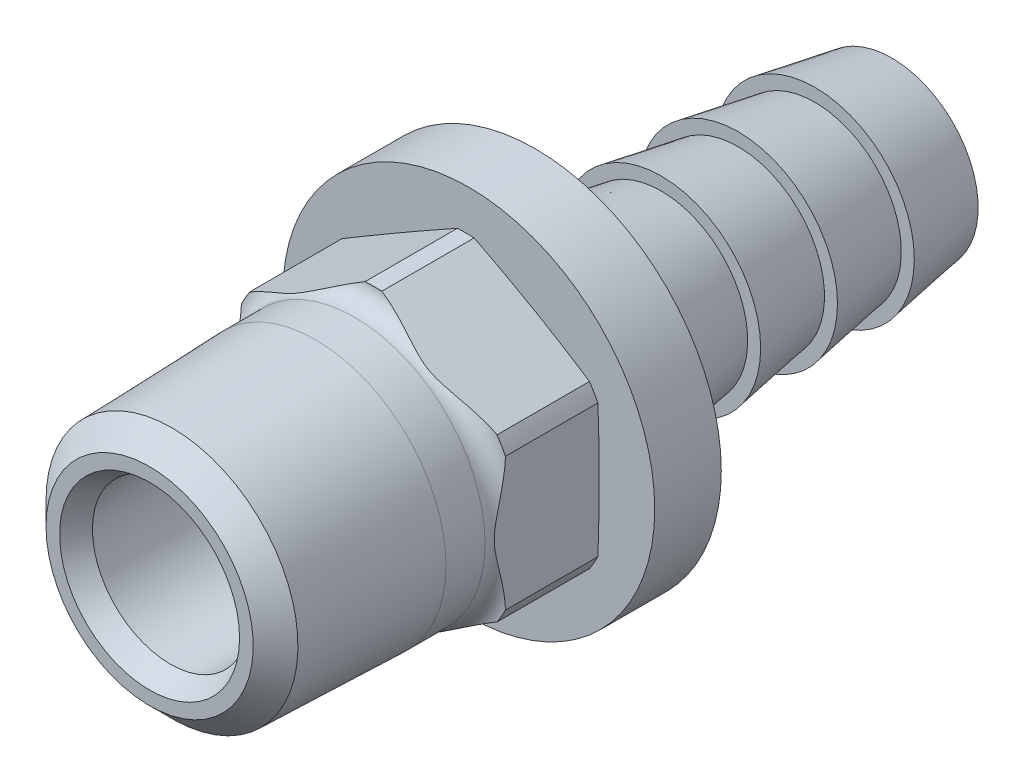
ISO-10303-21;
HEADER;
FILE_DESCRIPTION(('STEP AP214'),'2;1');
FILE_NAME('part.step','',(''),(''),'','','');
FILE_SCHEMA(('AUTOMOTIVE_DESIGN { 1 0 10303 214 1 1 1 1 }'));
ENDSEC;
DATA;
#1=APPLICATION_CONTEXT('core data for automotive mechanical design processes');
#2=APPLICATION_PROTOCOL_DEFINITION('international standard','automotive_design',2000,#1);
#3=PRODUCT_CONTEXT('',#1,'mechanical');
#4=PRODUCT('Part','Part','',(#3));
#5=PRODUCT_RELATED_PRODUCT_CATEGORY('part','',(#4));
#6=PRODUCT_DEFINITION_FORMATION('','',#4);
#7=PRODUCT_DEFINITION_CONTEXT('part definition',#1,'design');
#8=PRODUCT_DEFINITION('design','',#6,#7);
#9=PRODUCT_DEFINITION_SHAPE('','',#8);
#10=(LENGTH_UNIT() NAMED_UNIT(*) SI_UNIT(.MILLI.,.METRE.));
#11=(NAMED_UNIT(*) PLANE_ANGLE_UNIT() SI_UNIT($,.RADIAN.));
#12=(NAMED_UNIT(*) SI_UNIT($,.STERADIAN.) SOLID_ANGLE_UNIT());
#13=UNCERTAINTY_MEASURE_WITH_UNIT(LENGTH_MEASURE(1.E-05),#10,'distance_accuracy_value','');
#14=(GEOMETRIC_REPRESENTATION_CONTEXT(3) GLOBAL_UNCERTAINTY_ASSIGNED_CONTEXT((#13)) GLOBAL_UNIT_ASSIGNED_CONTEXT((#10,
#11,#12)) REPRESENTATION_CONTEXT('',''));
#15=CARTESIAN_POINT('',(0.,0.,0.));
#16=DIRECTION('',(0.,0.,1.));
#17=DIRECTION('',(1.,0.,0.));
#18=AXIS2_PLACEMENT_3D('',#15,#16,#17);
#19=CARTESIAN_POINT('',(0.,0.,-38.100206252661));
#20=DIRECTION('',(0.,0.,-1.));
#21=DIRECTION('',(-1.,0.,0.));
#22=AXIS2_PLACEMENT_3D('',#19,#20,#21);
#23=PLANE('',#22);
#24=CARTESIAN_POINT('',(0.,0.,-38.100206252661));
#25=DIRECTION('',(0.,0.,-1.));
#26=DIRECTION('',(-1.,0.,0.));
#27=AXIS2_PLACEMENT_3D('',#24,#25,#26);
#28=CIRCLE('',#27,5.1562);
#29=CARTESIAN_POINT('',(-5.1562,0.,-38.100206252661));
#30=VERTEX_POINT('',#29);
#31=EDGE_CURVE('E10',#30,#30,#28,.F.);
#32=ORIENTED_EDGE('',*,*,#31,.T.);
#33=EDGE_LOOP('',(#32));
#34=FACE_BOUND('',#33,.T.);
#35=CARTESIAN_POINT('',(0.,0.,-38.100206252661));
#36=DIRECTION('',(0.,0.,-1.));
#37=DIRECTION('',(-1.,0.,0.));
#38=AXIS2_PLACEMENT_3D('',#35,#36,#37);
#39=CIRCLE('',#38,5.715);
#40=CARTESIAN_POINT('',(-5.715,0.,-38.100206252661));
#41=VERTEX_POINT('',#40);
#42=EDGE_CURVE('E495',#41,#41,#39,.T.);
#43=ORIENTED_EDGE('',*,*,#42,.T.);
#44=EDGE_LOOP('',(#43));
#45=FACE_BOUND('',#44,.T.);
#46=ADVANCED_FACE('F15',(#34,#45),#23,.T.);
#47=CARTESIAN_POINT('',(0.,0.,10.972593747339));
#48=DIRECTION('',(0.,0.,-1.));
#49=DIRECTION('',(-1.,0.,0.));
#50=AXIS2_PLACEMENT_3D('',#47,#48,#49);
#51=CYLINDRICAL_SURFACE('',#50,9.779);
#52=CARTESIAN_POINT('',(0.,0.,-9.93520728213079));
#53=DIRECTION('',(0.,0.,1.));
#54=DIRECTION('',(0.,1.,0.));
#55=AXIS2_PLACEMENT_3D('',#52,#53,#54);
#56=CIRCLE('',#55,9.77899999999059);
#57=CARTESIAN_POINT('',(-8.1794925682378,-5.3595468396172,-9.93520728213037));
#58=VERTEX_POINT('',#57);
#59=CARTESIAN_POINT('',(-8.73125,-4.40387493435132,-9.93520728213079));
#60=VERTEX_POINT('',#59);
#61=EDGE_CURVE('E331',#58,#60,#56,.F.);
#62=ORIENTED_EDGE('',*,*,#61,.F.);
#63=DIRECTION('',(0.,0.,1.));
#64=VECTOR('',#63,1.);
#65=CARTESIAN_POINT('',(-8.17949256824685,-5.35954683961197,10.972593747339));
#66=LINE('',#65,#64);
#67=CARTESIAN_POINT('',(-8.17949256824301,-5.35954683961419,-3.82836817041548));
#68=VERTEX_POINT('',#67);
#69=EDGE_CURVE('E156',#68,#58,#66,.F.);
#70=ORIENTED_EDGE('',*,*,#69,.F.);
#71=CARTESIAN_POINT('',(0.,0.,-3.8283681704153));
#72=DIRECTION('',(0.,0.,-1.));
#73=DIRECTION('',(0.,1.,0.));
#74=AXIS2_PLACEMENT_3D('',#71,#72,#73);
#75=CIRCLE('',#74,9.77899999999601);
#76=CARTESIAN_POINT('',(-8.73124999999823,-4.40387493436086,-3.82836817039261));
#77=VERTEX_POINT('',#76);
#78=EDGE_CURVE('E349',#77,#68,#75,.F.);
#79=ORIENTED_EDGE('',*,*,#78,.F.);
#80=DIRECTION('',(0.,0.,1.));
#81=VECTOR('',#80,1.);
#82=CARTESIAN_POINT('',(-8.73125,-4.40387493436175,10.972593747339));
#83=LINE('',#82,#81);
#84=EDGE_CURVE('E320',#60,#77,#83,.T.);
#85=ORIENTED_EDGE('',*,*,#84,.F.);
#86=EDGE_LOOP('',(#62,#70,#79,#85));
#87=FACE_BOUND('',#86,.T.);
#88=ADVANCED_FACE('F17',(#87),#51,.T.);
#89=CARTESIAN_POINT('',(0.,0.,10.972593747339));
#90=DIRECTION('',(0.,0.,-1.));
#91=DIRECTION('',(-1.,0.,0.));
#92=AXIS2_PLACEMENT_3D('',#89,#90,#91);
#93=CYLINDRICAL_SURFACE('',#92,9.779);
#94=CARTESIAN_POINT('',(0.,0.,-9.93520728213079));
#95=DIRECTION('',(0.,0.,1.));
#96=DIRECTION('',(0.,1.,0.));
#97=AXIS2_PLACEMENT_3D('',#94,#95,#96);
#98=CIRCLE('',#97,9.7789999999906);
#99=CARTESIAN_POINT('',(-8.73125,4.40387493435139,-9.93520728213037));
#100=VERTEX_POINT('',#99);
#101=CARTESIAN_POINT('',(-8.17949256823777,5.35954683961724,-9.93520728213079));
#102=VERTEX_POINT('',#101);
#103=EDGE_CURVE('E329',#100,#102,#98,.F.);
#104=ORIENTED_EDGE('',*,*,#103,.F.);
#105=DIRECTION('',(0.,0.,1.));
#106=VECTOR('',#105,1.);
#107=CARTESIAN_POINT('',(-8.73125,4.40387493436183,10.972593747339));
#108=LINE('',#107,#106);
#109=CARTESIAN_POINT('',(-8.73125,4.40387493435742,-3.82836817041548));
#110=VERTEX_POINT('',#109);
#111=EDGE_CURVE('E324',#110,#100,#108,.F.);
#112=ORIENTED_EDGE('',*,*,#111,.F.);
#113=CARTESIAN_POINT('',(0.,0.,-3.82836817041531));
#114=DIRECTION('',(0.,0.,-1.));
#115=DIRECTION('',(0.,1.,0.));
#116=AXIS2_PLACEMENT_3D('',#113,#114,#115);
#117=CIRCLE('',#116,9.77899999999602);
#118=CARTESIAN_POINT('',(-8.17949256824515,5.35954683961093,-3.82836817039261));
#119=VERTEX_POINT('',#118);
#120=EDGE_CURVE('E319',#119,#110,#117,.F.);
#121=ORIENTED_EDGE('',*,*,#120,.F.);
#122=DIRECTION('',(0.,0.,1.));
#123=VECTOR('',#122,1.);
#124=CARTESIAN_POINT('',(-8.17949256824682,5.35954683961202,10.972593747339));
#125=LINE('',#124,#123);
#126=EDGE_CURVE('E220',#102,#119,#125,.T.);
#127=ORIENTED_EDGE('',*,*,#126,.F.);
#128=EDGE_LOOP('',(#104,#112,#121,#127));
#129=FACE_BOUND('',#128,.T.);
#130=ADVANCED_FACE('F437',(#129),#93,.T.);
#131=CARTESIAN_POINT('',(0.,0.,10.972593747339));
#132=DIRECTION('',(0.,0.,-1.));
#133=DIRECTION('',(-1.,0.,0.));
#134=AXIS2_PLACEMENT_3D('',#131,#132,#133);
#135=CYLINDRICAL_SURFACE('',#134,9.779);
#136=CARTESIAN_POINT('',(0.,0.,-9.93520728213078));
#137=DIRECTION('',(0.,0.,1.));
#138=DIRECTION('',(0.,1.,0.));
#139=AXIS2_PLACEMENT_3D('',#136,#137,#138);
#140=CIRCLE('',#139,9.77899999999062);
#141=CARTESIAN_POINT('',(-0.551757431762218,9.76342177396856,-9.93520728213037));
#142=VERTEX_POINT('',#141);
#143=CARTESIAN_POINT('',(0.551757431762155,9.76342177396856,-9.93520728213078));
#144=VERTEX_POINT('',#143);
#145=EDGE_CURVE('E340',#142,#144,#140,.F.);
#146=ORIENTED_EDGE('',*,*,#145,.F.);
#147=DIRECTION('',(0.,0.,1.));
#148=VECTOR('',#147,1.);
#149=CARTESIAN_POINT('',(-0.55175743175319,9.76342177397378,10.972593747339));
#150=LINE('',#149,#148);
#151=CARTESIAN_POINT('',(-0.551757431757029,9.76342177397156,-3.82836817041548));
#152=VERTEX_POINT('',#151);
#153=EDGE_CURVE('E221',#152,#142,#150,.F.);
#154=ORIENTED_EDGE('',*,*,#153,.F.);
#155=CARTESIAN_POINT('',(0.,0.,-3.82836817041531));
#156=DIRECTION('',(0.,0.,-1.));
#157=DIRECTION('',(0.,1.,0.));
#158=AXIS2_PLACEMENT_3D('',#155,#156,#157);
#159=CIRCLE('',#158,9.77899999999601);
#160=CARTESIAN_POINT('',(0.551757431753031,9.76342177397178,-3.82836817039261));
#161=VERTEX_POINT('',#160);
#162=EDGE_CURVE('E341',#161,#152,#159,.F.);
#163=ORIENTED_EDGE('',*,*,#162,.F.);
#164=DIRECTION('',(0.,0.,1.));
#165=VECTOR('',#164,1.);
#166=CARTESIAN_POINT('',(0.551757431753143,9.76342177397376,10.972593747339));
#167=LINE('',#166,#165);
#168=EDGE_CURVE('E312',#144,#161,#167,.T.);
#169=ORIENTED_EDGE('',*,*,#168,.F.);
#170=EDGE_LOOP('',(#146,#154,#163,#169));
#171=FACE_BOUND('',#170,.T.);
#172=ADVANCED_FACE('F748',(#171),#135,.T.);
#173=CARTESIAN_POINT('',(0.,0.,10.972593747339));
#174=DIRECTION('',(0.,0.,-1.));
#175=DIRECTION('',(-1.,0.,0.));
#176=AXIS2_PLACEMENT_3D('',#173,#174,#175);
#177=CYLINDRICAL_SURFACE('',#176,9.779);
#178=CARTESIAN_POINT('',(0.,0.,-9.93520728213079));
#179=DIRECTION('',(0.,0.,1.));
#180=DIRECTION('',(0.,1.,0.));
#181=AXIS2_PLACEMENT_3D('',#178,#179,#180);
#182=CIRCLE('',#181,9.77899999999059);
#183=CARTESIAN_POINT('',(8.1794925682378,5.35954683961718,-9.93520728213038));
#184=VERTEX_POINT('',#183);
#185=CARTESIAN_POINT('',(8.73125,4.40387493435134,-9.93520728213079));
#186=VERTEX_POINT('',#185);
#187=EDGE_CURVE('E332',#184,#186,#182,.F.);
#188=ORIENTED_EDGE('',*,*,#187,.F.);
#189=DIRECTION('',(0.,0.,1.));
#190=VECTOR('',#189,1.);
#191=CARTESIAN_POINT('',(8.17949256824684,5.35954683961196,10.972593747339));
#192=LINE('',#191,#190);
#193=CARTESIAN_POINT('',(8.17949256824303,5.35954683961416,-3.82836817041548));
#194=VERTEX_POINT('',#193);
#195=EDGE_CURVE('E315',#194,#184,#192,.F.);
#196=ORIENTED_EDGE('',*,*,#195,.F.);
#197=CARTESIAN_POINT('',(0.,0.,-3.82836817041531));
#198=DIRECTION('',(0.,0.,-1.));
#199=DIRECTION('',(0.,1.,0.));
#200=AXIS2_PLACEMENT_3D('',#197,#198,#199);
#201=CIRCLE('',#200,9.77899999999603);
#202=CARTESIAN_POINT('',(8.73124999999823,4.40387493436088,-3.82836817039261));
#203=VERTEX_POINT('',#202);
#204=EDGE_CURVE('E337',#203,#194,#201,.F.);
#205=ORIENTED_EDGE('',*,*,#204,.F.);
#206=DIRECTION('',(0.,0.,1.));
#207=VECTOR('',#206,1.);
#208=CARTESIAN_POINT('',(8.73125,4.40387493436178,10.972593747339));
#209=LINE('',#208,#207);
#210=EDGE_CURVE('E305',#186,#203,#209,.T.);
#211=ORIENTED_EDGE('',*,*,#210,.F.);
#212=EDGE_LOOP('',(#188,#196,#205,#211));
#213=FACE_BOUND('',#212,.T.);
#214=ADVANCED_FACE('F755',(#213),#177,.T.);
#215=CARTESIAN_POINT('',(0.,0.,10.972593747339));
#216=DIRECTION('',(0.,0.,-1.));
#217=DIRECTION('',(-1.,0.,0.));
#218=AXIS2_PLACEMENT_3D('',#215,#216,#217);
#219=CYLINDRICAL_SURFACE('',#218,9.779);
#220=CARTESIAN_POINT('',(0.,0.,-9.93520728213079));
#221=DIRECTION('',(0.,0.,1.));
#222=DIRECTION('',(0.,1.,0.));
#223=AXIS2_PLACEMENT_3D('',#220,#221,#222);
#224=CIRCLE('',#223,9.77899999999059);
#225=CARTESIAN_POINT('',(0.551757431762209,-9.76342177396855,-9.93520728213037));
#226=VERTEX_POINT('',#225);
#227=CARTESIAN_POINT('',(-0.551757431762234,-9.76342177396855,-9.93520728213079));
#228=VERTEX_POINT('',#227);
#229=EDGE_CURVE('E330',#226,#228,#224,.F.);
#230=ORIENTED_EDGE('',*,*,#229,.F.);
#231=DIRECTION('',(0.,0.,1.));
#232=VECTOR('',#231,1.);
#233=CARTESIAN_POINT('',(0.55175743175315,-9.76342177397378,10.972593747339));
#234=LINE('',#233,#232);
#235=CARTESIAN_POINT('',(0.551757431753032,-9.76342177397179,-3.82836817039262));
#236=VERTEX_POINT('',#235);
#237=EDGE_CURVE('E135',#236,#226,#234,.F.);
#238=ORIENTED_EDGE('',*,*,#237,.F.);
#239=CARTESIAN_POINT('',(0.,0.,-3.82836817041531));
#240=DIRECTION('',(0.,0.,-1.));
#241=DIRECTION('',(0.,1.,0.));
#242=AXIS2_PLACEMENT_3D('',#239,#240,#241);
#243=CIRCLE('',#242,9.77899999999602);
#244=CARTESIAN_POINT('',(-0.55175743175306,-9.76342177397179,-3.82836817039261));
#245=VERTEX_POINT('',#244);
#246=EDGE_CURVE('E128',#245,#236,#243,.F.);
#247=ORIENTED_EDGE('',*,*,#246,.F.);
#248=DIRECTION('',(0.,0.,1.));
#249=VECTOR('',#248,1.);
#250=CARTESIAN_POINT('',(-0.551757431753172,-9.76342177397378,10.972593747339));
#251=LINE('',#250,#249);
#252=EDGE_CURVE('E132',#228,#245,#251,.T.);
#253=ORIENTED_EDGE('',*,*,#252,.F.);
#254=EDGE_LOOP('',(#230,#238,#247,#253));
#255=FACE_BOUND('',#254,.T.);
#256=ADVANCED_FACE('F131',(#255),#219,.T.);
#257=CARTESIAN_POINT('',(0.,0.,-9.93520728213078));
#258=DIRECTION('',(0.,0.,1.));
#259=DIRECTION('',(1.,0.,0.));
#260=AXIS2_PLACEMENT_3D('',#257,#258,#259);
#261=CONICAL_SURFACE('',#260,9.77899999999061,1.4835298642);
#262=CARTESIAN_POINT('',(0.,0.,-10.1297782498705));
#263=DIRECTION('',(0.,0.,1.));
#264=DIRECTION('',(1.,0.,0.));
#265=AXIS2_PLACEMENT_3D('',#262,#263,#264);
#266=CIRCLE('',#265,7.5550436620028);
#267=CARTESIAN_POINT('',(7.5550436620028,0.,-10.1297782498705));
#268=VERTEX_POINT('',#267);
#269=EDGE_CURVE('E19',#268,#268,#266,.T.);
#270=ORIENTED_EDGE('',*,*,#269,.T.);
#271=EDGE_LOOP('',(#270));
#272=FACE_BOUND('',#271,.T.);
#273=ORIENTED_EDGE('',*,*,#103,.T.);
#274=CARTESIAN_POINT('',(-0.551757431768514,9.76342177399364,-9.93520728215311));
#275=CARTESIAN_POINT('',(-0.869484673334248,9.57998186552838,-9.94967126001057));
#276=CARTESIAN_POINT('',(-1.1872649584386,9.39651133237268,-9.96268166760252));
#277=CARTESIAN_POINT('',(-1.8229217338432,9.0295147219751,-9.98539761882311));
#278=CARTESIAN_POINT('',(-2.14079822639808,8.8459886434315,-9.99510307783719));
#279=CARTESIAN_POINT('',(-2.77648265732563,8.47897606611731,-10.0108072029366));
#280=CARTESIAN_POINT('',(-3.09429056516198,8.29548958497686,-10.0168074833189));
#281=CARTESIAN_POINT('',(-3.72994064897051,7.9284968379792,-10.0248406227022));
#282=CARTESIAN_POINT('',(-4.04778282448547,7.74499057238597,-10.0268735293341));
#283=CARTESIAN_POINT('',(-4.68346717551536,7.37797804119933,-10.0268735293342));
#284=CARTESIAN_POINT('',(-5.00130935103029,7.19447177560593,-10.0248406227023));
#285=CARTESIAN_POINT('',(-5.63695943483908,6.82747902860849,-10.0168074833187));
#286=CARTESIAN_POINT('',(-5.95476734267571,6.64399254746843,-10.010807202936));
#287=CARTESIAN_POINT('',(-6.59045177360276,6.27697997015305,-9.99510307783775));
#288=CARTESIAN_POINT('',(-6.90832826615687,6.09345389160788,-9.98539761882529));
#289=CARTESIAN_POINT('',(-7.54398504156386,5.72645728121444,-9.96268166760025));
#290=CARTESIAN_POINT('',(-7.86176532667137,5.54298674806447,-9.94967126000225));
#291=CARTESIAN_POINT('',(-8.1794925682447,5.35954683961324,-9.93520728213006));
#292=B_SPLINE_CURVE_WITH_KNOTS('',3,(#274,#275,#276,#277,#278,#279,#280,#281,#282,#283,#284,
#285,#286,#287,#288,#289,#290,#291),.UNSPECIFIED.,.F.,.F.,(4,2,2,2,2,2,2,2,4),(0.,
1.10149750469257,2.20302320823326,3.30406865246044,4.4051008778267,5.50613310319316,
6.60717854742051,7.70870425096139,8.81020175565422),.UNSPECIFIED.);
#293=EDGE_CURVE('E212',#142,#102,#292,.T.);
#294=ORIENTED_EDGE('',*,*,#293,.F.);
#295=ORIENTED_EDGE('',*,*,#145,.T.);
#296=CARTESIAN_POINT('',(8.17949256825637,5.35954683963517,-9.93520728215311));
#297=CARTESIAN_POINT('',(7.8617653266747,5.54298674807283,-9.94967126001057));
#298=CARTESIAN_POINT('',(7.54398504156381,5.72645728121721,-9.96268166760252));
#299=CARTESIAN_POINT('',(6.90832826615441,6.0934538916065,-9.98539761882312));
#300=CARTESIAN_POINT('',(6.59045177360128,6.27697997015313,-9.99510307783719));
#301=CARTESIAN_POINT('',(5.95476734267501,6.64399254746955,-10.0108072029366));
#302=CARTESIAN_POINT('',(5.63695943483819,6.82747902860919,-10.0168074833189));
#303=CARTESIAN_POINT('',(5.00130935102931,7.19447177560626,-10.0248406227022));
#304=CARTESIAN_POINT('',(4.68346717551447,7.37797804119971,-10.0268735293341));
#305=CARTESIAN_POINT('',(4.04778282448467,7.7449905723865,-10.0268735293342));
#306=CARTESIAN_POINT('',(3.7299406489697,7.92849683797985,-10.0248406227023));
#307=CARTESIAN_POINT('',(3.09429056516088,8.29548958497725,-10.0168074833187));
#308=CARTESIAN_POINT('',(2.77648265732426,8.47897606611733,-10.010807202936));
#309=CARTESIAN_POINT('',(2.14079822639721,8.84598864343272,-9.99510307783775));
#310=CARTESIAN_POINT('',(1.82292173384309,9.02951472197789,-9.98539761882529));
#311=CARTESIAN_POINT('',(1.18726495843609,9.39651133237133,-9.96268166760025));
#312=CARTESIAN_POINT('',(0.869484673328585,9.5799818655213,-9.94967126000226));
#313=CARTESIAN_POINT('',(0.551757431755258,9.76342177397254,-9.93520728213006));
#314=B_SPLINE_CURVE_WITH_KNOTS('',3,(#296,#297,#298,#299,#300,#301,#302,#303,#304,#305,#306,
#307,#308,#309,#310,#311,#312,#313),.UNSPECIFIED.,.F.,.F.,(4,2,2,2,2,2,2,2,4),(0.,
1.10149750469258,2.20302320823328,3.30406865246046,4.40510087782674,5.5061331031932,
6.60717854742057,7.70870425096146,8.81020175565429),.UNSPECIFIED.);
#315=EDGE_CURVE('E204',#184,#144,#314,.T.);
#316=ORIENTED_EDGE('',*,*,#315,.F.);
#317=ORIENTED_EDGE('',*,*,#187,.T.);
#318=CARTESIAN_POINT('',(8.73125000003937,-4.40387493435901,-9.93520728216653));
#319=CARTESIAN_POINT('',(8.73125000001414,-4.03699511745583,-9.94967126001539));
#320=CARTESIAN_POINT('',(8.73125000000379,-3.67005405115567,-9.96268166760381));
#321=CARTESIAN_POINT('',(8.73124999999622,-2.93606083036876,-9.98539761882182));
#322=CARTESIAN_POINT('',(8.73124999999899,-2.5690086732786,-9.99510307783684));
#323=CARTESIAN_POINT('',(8.73125000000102,-1.83498351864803,-10.0108072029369));
#324=CARTESIAN_POINT('',(8.73125000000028,-1.46801055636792,-10.016807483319));
#325=CARTESIAN_POINT('',(8.73124999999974,-0.734025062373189,-10.0248406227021));
#326=CARTESIAN_POINT('',(8.73124999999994,-0.367012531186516,-10.0268735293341));
#327=CARTESIAN_POINT('',(8.73125000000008,0.36701253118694,-10.0268735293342));
#328=CARTESIAN_POINT('',(8.73125000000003,0.734025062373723,-10.0248406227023));
#329=CARTESIAN_POINT('',(8.73124999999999,1.46801055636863,-10.0168074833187));
#330=CARTESIAN_POINT('',(8.73125000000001,1.83498351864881,-10.010807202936));
#331=CARTESIAN_POINT('',(8.73125000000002,2.56900867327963,-9.99510307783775));
#332=CARTESIAN_POINT('',(8.73125000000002,2.93606083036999,-9.98539761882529));
#333=CARTESIAN_POINT('',(8.73125000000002,3.67005405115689,-9.96268166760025));
#334=CARTESIAN_POINT('',(8.73125000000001,4.03699511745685,-9.94967126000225));
#335=CARTESIAN_POINT('',(8.73125,4.40387493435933,-9.93520728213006));
#336=B_SPLINE_CURVE_WITH_KNOTS('',3,(#318,#319,#320,#321,#322,#323,#324,#325,#326,#327,#328,
#329,#330,#331,#332,#333,#334,#335),.UNSPECIFIED.,.F.,.F.,(4,2,2,2,2,2,2,2,4),(0.,
1.10149750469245,2.20302320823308,3.30406865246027,4.40510087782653,5.50613310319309,
6.60717854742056,7.70870425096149,8.81020175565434),.UNSPECIFIED.);
#337=CARTESIAN_POINT('',(8.73125,-4.40387493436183,-9.93520728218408));
#338=VERTEX_POINT('',#337);
#339=EDGE_CURVE('E196',#338,#186,#336,.T.);
#340=ORIENTED_EDGE('',*,*,#339,.F.);
#341=CARTESIAN_POINT('',(0.,0.,-9.9352072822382));
#342=DIRECTION('',(0.,0.,-1.));
#343=DIRECTION('',(-1.,0.,0.));
#344=AXIS2_PLACEMENT_3D('',#341,#342,#343);
#345=CIRCLE('',#344,9.779);
#346=CARTESIAN_POINT('',(8.17949256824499,-5.35954683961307,-9.93520728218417));
#347=VERTEX_POINT('',#346);
#348=EDGE_CURVE('E327',#347,#338,#345,.F.);
#349=ORIENTED_EDGE('',*,*,#348,.F.);
#350=CARTESIAN_POINT('',(0.551757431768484,-9.76342177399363,-9.9352072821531));
#351=CARTESIAN_POINT('',(0.869484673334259,-9.57998186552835,-9.94967126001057));
#352=CARTESIAN_POINT('',(1.18726495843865,-9.39651133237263,-9.96268166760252));
#353=CARTESIAN_POINT('',(1.82292173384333,-9.029514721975,-9.98539761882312));
#354=CARTESIAN_POINT('',(2.14079822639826,-8.84598864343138,-9.99510307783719));
#355=CARTESIAN_POINT('',(2.77648265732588,-8.47897606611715,-10.0108072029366));
#356=CARTESIAN_POINT('',(3.09429056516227,-8.29548958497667,-10.0168074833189));
#357=CARTESIAN_POINT('',(3.72994064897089,-7.92849683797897,-10.0248406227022));
#358=CARTESIAN_POINT('',(4.04778282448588,-7.74499057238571,-10.0268735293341));
#359=CARTESIAN_POINT('',(4.68346717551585,-7.37797804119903,-10.0268735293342));
#360=CARTESIAN_POINT('',(5.00130935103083,-7.19447177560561,-10.0248406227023));
#361=CARTESIAN_POINT('',(5.63695943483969,-6.82747902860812,-10.0168074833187));
#362=CARTESIAN_POINT('',(5.95476734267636,-6.64399254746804,-10.010807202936));
#363=CARTESIAN_POINT('',(6.5904517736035,-6.27697997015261,-9.99510307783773));
#364=CARTESIAN_POINT('',(6.90832826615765,-6.09345389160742,-9.98539761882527));
#365=CARTESIAN_POINT('',(7.54398504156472,-5.72645728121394,-9.96268166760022));
#366=CARTESIAN_POINT('',(7.86176532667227,-5.54298674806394,-9.94967126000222));
#367=CARTESIAN_POINT('',(8.17949256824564,-5.3595468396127,-9.93520728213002));
#368=B_SPLINE_CURVE_WITH_KNOTS('',3,(#350,#351,#352,#353,#354,#355,#356,#357,#358,#359,#360,
#361,#362,#363,#364,#365,#366,#367),.UNSPECIFIED.,.F.,.F.,(4,2,2,2,2,2,2,2,4),(0.,
1.10149750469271,2.20302320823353,3.30406865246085,4.40510087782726,5.50613310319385,
6.60717854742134,7.70870425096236,8.81020175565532),.UNSPECIFIED.);
#369=EDGE_CURVE('E187',#226,#347,#368,.T.);
#370=ORIENTED_EDGE('',*,*,#369,.F.);
#371=ORIENTED_EDGE('',*,*,#229,.T.);
#372=CARTESIAN_POINT('',(-8.17949256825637,-5.35954683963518,-9.9352072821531));
#373=CARTESIAN_POINT('',(-7.8617653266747,-5.54298674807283,-9.94967126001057));
#374=CARTESIAN_POINT('',(-7.54398504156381,-5.72645728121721,-9.96268166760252));
#375=CARTESIAN_POINT('',(-6.90832826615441,-6.09345389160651,-9.98539761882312));
#376=CARTESIAN_POINT('',(-6.59045177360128,-6.27697997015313,-9.99510307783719));
#377=CARTESIAN_POINT('',(-5.95476734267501,-6.64399254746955,-10.0108072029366));
#378=CARTESIAN_POINT('',(-5.63695943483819,-6.82747902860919,-10.0168074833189));
#379=CARTESIAN_POINT('',(-5.00130935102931,-7.19447177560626,-10.0248406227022));
#380=CARTESIAN_POINT('',(-4.68346717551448,-7.37797804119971,-10.0268735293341));
#381=CARTESIAN_POINT('',(-4.04778282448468,-7.7449905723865,-10.0268735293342));
#382=CARTESIAN_POINT('',(-3.72994064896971,-7.92849683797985,-10.0248406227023));
#383=CARTESIAN_POINT('',(-3.09429056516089,-8.29548958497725,-10.0168074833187));
#384=CARTESIAN_POINT('',(-2.77648265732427,-8.47897606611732,-10.010807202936));
#385=CARTESIAN_POINT('',(-2.14079822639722,-8.84598864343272,-9.99510307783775));
#386=CARTESIAN_POINT('',(-1.82292173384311,-9.02951472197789,-9.98539761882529));
#387=CARTESIAN_POINT('',(-1.18726495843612,-9.39651133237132,-9.96268166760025));
#388=CARTESIAN_POINT('',(-0.869484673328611,-9.5799818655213,-9.94967126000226));
#389=CARTESIAN_POINT('',(-0.551757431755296,-9.76342177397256,-9.93520728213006));
#390=B_SPLINE_CURVE_WITH_KNOTS('',3,(#372,#373,#374,#375,#376,#377,#378,#379,#380,#381,#382,
#383,#384,#385,#386,#387,#388,#389),.UNSPECIFIED.,.F.,.F.,(4,2,2,2,2,2,2,2,4),(0.,
1.10149750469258,2.20302320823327,3.30406865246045,4.40510087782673,5.50613310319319,
6.60717854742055,7.70870425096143,8.81020175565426),.UNSPECIFIED.);
#391=EDGE_CURVE('E149',#58,#228,#390,.T.);
#392=ORIENTED_EDGE('',*,*,#391,.F.);
#393=ORIENTED_EDGE('',*,*,#61,.T.);
#394=CARTESIAN_POINT('',(-8.73125000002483,4.40387493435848,-9.9352072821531));
#395=CARTESIAN_POINT('',(-8.73125000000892,4.03699511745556,-9.94967126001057));
#396=CARTESIAN_POINT('',(-8.73125000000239,3.67005405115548,-9.96268166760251));
#397=CARTESIAN_POINT('',(-8.73124999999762,2.9360608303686,-9.98539761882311));
#398=CARTESIAN_POINT('',(-8.73124999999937,2.56900867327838,-9.99510307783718));
#399=CARTESIAN_POINT('',(-8.73125000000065,1.83498351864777,-10.0108072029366));
#400=CARTESIAN_POINT('',(-8.73125000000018,1.46801055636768,-10.0168074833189));
#401=CARTESIAN_POINT('',(-8.73124999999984,0.73402506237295,-10.0248406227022));
#402=CARTESIAN_POINT('',(-8.73124999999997,0.367012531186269,-10.0268735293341));
#403=CARTESIAN_POINT('',(-8.73125000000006,-0.367012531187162,-10.0268735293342));
#404=CARTESIAN_POINT('',(-8.73125000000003,-0.734025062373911,-10.0248406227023));
#405=CARTESIAN_POINT('',(-8.73125000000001,-1.46801055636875,-10.0168074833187));
#406=CARTESIAN_POINT('',(-8.73125000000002,-1.83498351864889,-10.010807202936));
#407=CARTESIAN_POINT('',(-8.73125000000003,-2.56900867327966,-9.99510307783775));
#408=CARTESIAN_POINT('',(-8.73125000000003,-2.93606083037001,-9.98539761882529));
#409=CARTESIAN_POINT('',(-8.73125000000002,-3.67005405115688,-9.96268166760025));
#410=CARTESIAN_POINT('',(-8.73125000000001,-4.03699511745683,-9.94967126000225));
#411=CARTESIAN_POINT('',(-8.73125,-4.4038749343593,-9.93520728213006));
#412=B_SPLINE_CURVE_WITH_KNOTS('',3,(#394,#395,#396,#397,#398,#399,#400,#401,#402,#403,#404,
#405,#406,#407,#408,#409,#410,#411),.UNSPECIFIED.,.F.,.F.,(4,2,2,2,2,2,2,2,4),(0.,
1.10149750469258,2.20302320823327,3.30406865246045,4.40510087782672,5.50613310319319,
6.60717854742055,7.70870425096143,8.81020175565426),.UNSPECIFIED.);
#413=EDGE_CURVE('E323',#100,#60,#412,.T.);
#414=ORIENTED_EDGE('',*,*,#413,.F.);
#415=EDGE_LOOP('',(#273,#294,#295,#316,#317,#340,#349,#370,#371,#392,#393,#414));
#416=FACE_BOUND('',#415,.T.);
#417=ADVANCED_FACE('F172',(#272,#416),#261,.T.);
#418=CARTESIAN_POINT('',(0.,0.,10.972593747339));
#419=DIRECTION('',(0.,0.,-1.));
#420=DIRECTION('',(-1.,0.,0.));
#421=AXIS2_PLACEMENT_3D('',#418,#419,#420);
#422=CYLINDRICAL_SURFACE('',#421,9.779);
#423=ORIENTED_EDGE('',*,*,#348,.T.);
#424=DIRECTION('',(0.,0.,1.));
#425=VECTOR('',#424,1.);
#426=CARTESIAN_POINT('',(8.73125,-4.40387493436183,10.972593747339));
#427=LINE('',#426,#425);
#428=CARTESIAN_POINT('',(8.73125,-4.40387493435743,-3.82836817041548));
#429=VERTEX_POINT('',#428);
#430=EDGE_CURVE('E308',#429,#338,#427,.F.);
#431=ORIENTED_EDGE('',*,*,#430,.F.);
#432=CARTESIAN_POINT('',(0.,0.,-3.82836817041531));
#433=DIRECTION('',(0.,0.,-1.));
#434=DIRECTION('',(0.,1.,0.));
#435=AXIS2_PLACEMENT_3D('',#432,#433,#434);
#436=CIRCLE('',#435,9.77899999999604);
#437=CARTESIAN_POINT('',(8.17949256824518,-5.35954683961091,-3.82836817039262));
#438=VERTEX_POINT('',#437);
#439=EDGE_CURVE('E334',#438,#429,#436,.F.);
#440=ORIENTED_EDGE('',*,*,#439,.F.);
#441=DIRECTION('',(0.,0.,1.));
#442=VECTOR('',#441,1.);
#443=CARTESIAN_POINT('',(8.17949256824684,-5.35954683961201,10.972593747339));
#444=LINE('',#443,#442);
#445=EDGE_CURVE('E301',#347,#438,#444,.T.);
#446=ORIENTED_EDGE('',*,*,#445,.F.);
#447=EDGE_LOOP('',(#423,#431,#440,#446));
#448=FACE_BOUND('',#447,.T.);
#449=ADVANCED_FACE('F177',(#448),#422,.T.);
#450=CARTESIAN_POINT('',(0.,0.,-10.1297782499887));
#451=DIRECTION('',(0.,0.,-1.));
#452=DIRECTION('',(0.,1.,0.));
#453=AXIS2_PLACEMENT_3D('',#450,#451,#452);
#454=PLANE('',#453);
#455=ORIENTED_EDGE('',*,*,#269,.F.);
#456=EDGE_LOOP('',(#455));
#457=FACE_BOUND('',#456,.T.);
#458=CARTESIAN_POINT('',(0.,0.,-10.1297782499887));
#459=DIRECTION('',(0.,0.,-1.));
#460=DIRECTION('',(0.,1.,0.));
#461=AXIS2_PLACEMENT_3D('',#458,#459,#460);
#462=CIRCLE('',#461,12.3);
#463=CARTESIAN_POINT('',(0.,12.3,-10.1297782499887));
#464=VERTEX_POINT('',#463);
#465=EDGE_CURVE('E300',#464,#464,#462,.T.);
#466=ORIENTED_EDGE('',*,*,#465,.F.);
#467=EDGE_LOOP('',(#466));
#468=FACE_BOUND('',#467,.T.);
#469=ADVANCED_FACE('F782',(#457,#468),#454,.F.);
#470=CARTESIAN_POINT('',(0.,0.,-3.82836817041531));
#471=DIRECTION('',(0.,0.,-1.));
#472=DIRECTION('',(-1.,0.,0.));
#473=AXIS2_PLACEMENT_3D('',#470,#471,#472);
#474=CONICAL_SURFACE('',#473,9.77899999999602,1.48352986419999);
#475=DIRECTION('',(0.865357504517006,-0.499614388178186,-0.0392664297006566));
#476=VECTOR('',#475,1.);
#477=CARTESIAN_POINT('',(-0.576715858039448,-9.74901201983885,-3.82723565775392));
#478=LINE('',#477,#476);
#479=CARTESIAN_POINT('',(-0.576715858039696,-9.74901201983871,-3.82723565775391));
#480=VERTEX_POINT('',#479);
#481=EDGE_CURVE('E140',#245,#480,#478,.F.);
#482=ORIENTED_EDGE('',*,*,#481,.F.);
#483=ORIENTED_EDGE('',*,*,#246,.T.);
#484=DIRECTION('',(0.865357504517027,0.49961438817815,0.039266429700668));
#485=VECTOR('',#484,1.);
#486=CARTESIAN_POINT('',(0.55175743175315,-9.76342177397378,-3.82836817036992));
#487=LINE('',#486,#485);
#488=CARTESIAN_POINT('',(0.57671585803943,-9.74901201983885,-3.82723565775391));
#489=VERTEX_POINT('',#488);
#490=EDGE_CURVE('E304',#489,#236,#487,.F.);
#491=ORIENTED_EDGE('',*,*,#490,.F.);
#492=CARTESIAN_POINT('',(0.,0.,-3.8272356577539));
#493=DIRECTION('',(0.,0.,-1.));
#494=DIRECTION('',(-1.,0.,0.));
#495=AXIS2_PLACEMENT_3D('',#492,#493,#494);
#496=CIRCLE('',#495,9.76605532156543);
#497=EDGE_CURVE('E155',#489,#480,#496,.T.);
#498=ORIENTED_EDGE('',*,*,#497,.T.);
#499=EDGE_LOOP('',(#482,#483,#491,#498));
#500=FACE_BOUND('',#499,.T.);
#501=ADVANCED_FACE('F153',(#500),#474,.T.);
#502=CARTESIAN_POINT('',(-8.73125,-5.0409895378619,10.972593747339));
#503=DIRECTION('',(-0.5,-0.866025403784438,0.));
#504=DIRECTION('',(0.866025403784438,-0.5,0.));
#505=AXIS2_PLACEMENT_3D('',#502,#503,#504);
#506=PLANE('',#505);
#507=ORIENTED_EDGE('',*,*,#391,.T.);
#508=ORIENTED_EDGE('',*,*,#252,.T.);
#509=ORIENTED_EDGE('',*,*,#481,.T.);
#510=CARTESIAN_POINT('',(-0.576715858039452,-9.74901201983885,-3.8272356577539));
#511=CARTESIAN_POINT('',(-0.667774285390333,-9.69643941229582,-3.82309806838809));
#512=CARTESIAN_POINT('',(-0.758718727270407,-9.64393261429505,-3.81642554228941));
#513=CARTESIAN_POINT('',(-0.93996160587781,-9.53929198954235,-3.79872576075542));
#514=CARTESIAN_POINT('',(-1.03026118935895,-9.48715750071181,-3.78771436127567));
#515=CARTESIAN_POINT('',(-1.21030131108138,-9.38321128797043,-3.76203430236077));
#516=CARTESIAN_POINT('',(-1.30004254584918,-9.33139916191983,-3.7473719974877));
#517=CARTESIAN_POINT('',(-1.47906076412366,-9.22804294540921,-3.71497163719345));
#518=CARTESIAN_POINT('',(-1.5683379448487,-9.17649874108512,-3.69723502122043));
#519=CARTESIAN_POINT('',(-1.74724276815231,-9.07320799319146,-3.65907012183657));
#520=CARTESIAN_POINT('',(-1.83686691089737,-9.02146347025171,-3.63862018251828));
#521=CARTESIAN_POINT('',(-2.01582486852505,-8.91814204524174,-3.59567765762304));
#522=CARTESIAN_POINT('',(-2.10515836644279,-8.86656532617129,-3.57318332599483));
#523=CARTESIAN_POINT('',(-2.2836333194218,-8.76352276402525,-3.52670807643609));
#524=CARTESIAN_POINT('',(-2.37277446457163,-8.71205709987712,-3.50272558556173));
#525=CARTESIAN_POINT('',(-2.55097459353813,-8.60917320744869,-3.45389005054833));
#526=CARTESIAN_POINT('',(-2.64003339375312,-8.55775508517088,-3.42903612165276));
#527=CARTESIAN_POINT('',(-2.80317229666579,-8.46356679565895,-3.38339849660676));
#528=CARTESIAN_POINT('',(-2.87725610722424,-8.42079448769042,-3.36263222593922));
#529=CARTESIAN_POINT('',(-3.02549564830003,-8.33520834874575,-3.32154676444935));
#530=CARTESIAN_POINT('',(-3.09965135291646,-8.29239453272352,-3.30122745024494));
#531=CARTESIAN_POINT('',(-3.24809977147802,-8.20668779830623,-3.26170238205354));
#532=CARTESIAN_POINT('',(-3.32239223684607,-8.16379502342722,-3.24249539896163));
#533=CARTESIAN_POINT('',(-3.47121335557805,-8.07787311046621,-3.20603246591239));
#534=CARTESIAN_POINT('',(-3.54574141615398,-8.03484431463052,-3.18877334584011));
#535=CARTESIAN_POINT('',(-3.69517167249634,-7.94857071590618,-3.15723867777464));
#536=CARTESIAN_POINT('',(-3.77007318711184,-7.90532630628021,-3.14295892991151));
#537=CARTESIAN_POINT('',(-3.92031225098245,-7.81858574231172,-3.11858654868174));
#538=CARTESIAN_POINT('',(-3.99564917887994,-7.77508994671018,-3.1084889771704));
#539=CARTESIAN_POINT('',(-4.14675261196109,-7.6878503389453,-3.09362260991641));
#540=CARTESIAN_POINT('',(-4.22251921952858,-7.64410646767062,-3.08885514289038));
#541=CARTESIAN_POINT('',(-4.37419258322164,-7.55653781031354,-3.08532972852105));
#542=CARTESIAN_POINT('',(-4.45009938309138,-7.51271299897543,-3.08657417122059));
#543=CARTESIAN_POINT('',(-4.60176166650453,-7.42515073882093,-3.09489744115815));
#544=CARTESIAN_POINT('',(-4.67751681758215,-7.38141348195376,-3.10198397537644));
#545=CARTESIAN_POINT('',(-4.82861267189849,-7.29417824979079,-3.12106752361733));
#546=CARTESIAN_POINT('',(-4.90395293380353,-7.25068052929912,-3.13306901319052));
#547=CARTESIAN_POINT('',(-5.06642838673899,-7.15687528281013,-3.16300724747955));
#548=CARTESIAN_POINT('',(-5.15347107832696,-7.10662116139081,-3.18159466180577));
#549=CARTESIAN_POINT('',(-5.3270113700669,-7.00642762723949,-3.22192209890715));
#550=CARTESIAN_POINT('',(-5.41350883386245,-6.95648829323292,-3.24366288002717));
#551=CARTESIAN_POINT('',(-5.58622302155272,-6.85677171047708,-3.28888949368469));
#552=CARTESIAN_POINT('',(-5.67243948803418,-6.80699461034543,-3.31237661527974));
#553=CARTESIAN_POINT('',(-5.8447789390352,-6.70749438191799,-3.36002884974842));
#554=CARTESIAN_POINT('',(-5.93090184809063,-6.65777129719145,-3.38419432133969));
#555=CARTESIAN_POINT('',(-6.10319125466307,-6.55829996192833,-3.43237917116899));
#556=CARTESIAN_POINT('',(-6.18935775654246,-6.50855170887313,-3.4563985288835));
#557=CARTESIAN_POINT('',(-6.36183849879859,-6.40896990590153,-3.50362622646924));
#558=CARTESIAN_POINT('',(-6.44815270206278,-6.35913637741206,-3.52683474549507));
#559=CARTESIAN_POINT('',(-6.62320292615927,-6.25807108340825,-3.57244400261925));
#560=CARTESIAN_POINT('',(-6.71194574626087,-6.20683539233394,-3.59481024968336));
#561=CARTESIAN_POINT('',(-6.88977713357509,-6.10416439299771,-3.63754599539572));
#562=CARTESIAN_POINT('',(-6.97886563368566,-6.05272912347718,-3.65791586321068));
#563=CARTESIAN_POINT('',(-7.15750219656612,-5.94959325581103,-3.69613490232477));
#564=CARTESIAN_POINT('',(-7.24705048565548,-5.89789252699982,-3.7139826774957));
#565=CARTESIAN_POINT('',(-7.4267218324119,-5.79415922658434,-3.74661601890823));
#566=CARTESIAN_POINT('',(-7.51684560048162,-5.7421262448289,-3.7613964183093));
#567=CARTESIAN_POINT('',(-7.69779585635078,-5.63765456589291,-3.78730971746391));
#568=CARTESIAN_POINT('',(-7.7886236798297,-5.58521509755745,-3.79843048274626));
#569=CARTESIAN_POINT('',(-7.97110581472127,-5.47985898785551,-3.81632057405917));
#570=CARTESIAN_POINT('',(-8.06276191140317,-5.42694131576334,-3.82306530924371));
#571=CARTESIAN_POINT('',(-8.1545341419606,-5.37395659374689,-3.8272356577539));
#572=B_SPLINE_CURVE_WITH_KNOTS('',3,(#510,#511,#512,#513,#514,#515,#516,#517,#518,#519,#520,
#521,#522,#523,#524,#525,#526,#527,#528,#529,#530,#531,#532,#533,#534,#535,#536,#537,#538,#539,
#540,#541,#542,#543,#544,#545,#546,#547,#548,#549,#550,#551,#552,#553,#554,#555,#556,#557,#558,
#559,#560,#561,#562,#563,#564,#565,#566,#567,#568,#569,#570,#571),.UNSPECIFIED.,.F.,.F.,(4,2,2,
2,2,2,2,2,2,2,2,2,2,2,2,2,2,2,2,2,2,2,2,2,2,2,2,2,2,2,4),(0.,0.315603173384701,
0.630063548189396,0.943980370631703,1.25775060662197,1.57419553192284,1.89091330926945,
2.2079717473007,2.52536198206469,2.78944940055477,3.05346297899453,3.31717903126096,
3.58045950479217,3.84336629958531,4.1059617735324,4.36862269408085,4.63138804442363,
4.89450059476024,5.15785326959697,5.46440630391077,5.77103318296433,6.07788868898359,
6.38490963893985,6.69197276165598,6.99896760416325,7.31360470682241,7.62818351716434,
7.94293578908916,8.25821401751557,8.57452734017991,8.89260311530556),.UNSPECIFIED.);
#573=CARTESIAN_POINT('',(-8.15453414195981,-5.37395659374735,-3.82723565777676));
#574=VERTEX_POINT('',#573);
#575=EDGE_CURVE('E298',#480,#574,#572,.T.);
#576=ORIENTED_EDGE('',*,*,#575,.T.);
#577=CARTESIAN_POINT('',(-8.17949256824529,-5.35954683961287,-3.82836817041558));
#578=CARTESIAN_POINT('',(-8.17533284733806,-5.3619484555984,-3.82817892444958));
#579=CARTESIAN_POINT('',(-8.17117311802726,-5.36435007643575,-3.82798992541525));
#580=CARTESIAN_POINT('',(-8.16285364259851,-5.36915332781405,-3.82761242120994));
#581=CARTESIAN_POINT('',(-8.15869389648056,-5.37155495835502,-3.82742391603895));
#582=CARTESIAN_POINT('',(-8.15453414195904,-5.37395659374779,-3.82723565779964));
#583=B_SPLINE_CURVE_WITH_KNOTS('',3,(#577,#578,#579,#580,#581,#582),.UNSPECIFIED.,.F.,.F.,(4,2,
4),(0.,0.0144208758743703,0.0288417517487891),.UNSPECIFIED.);
#584=EDGE_CURVE('E150',#68,#574,#583,.T.);
#585=ORIENTED_EDGE('',*,*,#584,.F.);
#586=ORIENTED_EDGE('',*,*,#69,.T.);
#587=EDGE_LOOP('',(#507,#508,#509,#576,#585,#586));
#588=FACE_BOUND('',#587,.T.);
#589=ADVANCED_FACE('F145',(#588),#506,.T.);
#590=CARTESIAN_POINT('',(0.,0.,-3.8283681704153));
#591=DIRECTION('',(0.,0.,-1.));
#592=DIRECTION('',(-1.,0.,0.));
#593=AXIS2_PLACEMENT_3D('',#590,#591,#592);
#594=CONICAL_SURFACE('',#593,9.77899999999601,1.48352986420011);
#595=DIRECTION('',(0.,-0.999228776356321,-0.0392664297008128));
#596=VECTOR('',#595,1.);
#597=CARTESIAN_POINT('',(-8.73125,-4.37505542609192,-3.82723565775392));
#598=LINE('',#597,#596);
#599=CARTESIAN_POINT('',(-8.73125,-4.37505542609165,-3.8272356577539));
#600=VERTEX_POINT('',#599);
#601=EDGE_CURVE('E325',#77,#600,#598,.F.);
#602=ORIENTED_EDGE('',*,*,#601,.F.);
#603=ORIENTED_EDGE('',*,*,#78,.T.);
#604=ORIENTED_EDGE('',*,*,#584,.T.);
#605=CARTESIAN_POINT('',(0.,0.,-3.8272356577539));
#606=DIRECTION('',(0.,0.,-1.));
#607=DIRECTION('',(-1.,0.,0.));
#608=AXIS2_PLACEMENT_3D('',#605,#606,#607);
#609=CIRCLE('',#608,9.76605532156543);
#610=EDGE_CURVE('E295',#574,#600,#609,.T.);
#611=ORIENTED_EDGE('',*,*,#610,.T.);
#612=EDGE_LOOP('',(#602,#603,#604,#611));
#613=FACE_BOUND('',#612,.T.);
#614=ADVANCED_FACE('F803',(#613),#594,.T.);
#615=CARTESIAN_POINT('',(-8.73125,5.04098953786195,10.972593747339));
#616=DIRECTION('',(-1.,0.,0.));
#617=DIRECTION('',(0.,-1.,0.));
#618=AXIS2_PLACEMENT_3D('',#615,#616,#617);
#619=PLANE('',#618);
#620=ORIENTED_EDGE('',*,*,#413,.T.);
#621=ORIENTED_EDGE('',*,*,#84,.T.);
#622=ORIENTED_EDGE('',*,*,#601,.T.);
#623=CARTESIAN_POINT('',(-8.73125,-4.37505542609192,-3.8272356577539));
#624=CARTESIAN_POINT('',(-8.73125000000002,-4.26991021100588,-3.82309806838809));
#625=CARTESIAN_POINT('',(-8.73125000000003,-4.16489661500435,-3.81642554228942));
#626=CARTESIAN_POINT('',(-8.73125000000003,-3.95561536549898,-3.79872576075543));
#627=CARTESIAN_POINT('',(-8.73125000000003,-3.85134638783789,-3.78771436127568));
#628=CARTESIAN_POINT('',(-8.73125000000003,-3.64345396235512,-3.76203430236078));
#629=CARTESIAN_POINT('',(-8.73125000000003,-3.53982971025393,-3.74737199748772));
#630=CARTESIAN_POINT('',(-8.73125000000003,-3.33311727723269,-3.71497163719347));
#631=CARTESIAN_POINT('',(-8.73125000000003,-3.23002886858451,-3.69723502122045));
#632=CARTESIAN_POINT('',(-8.73125000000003,-3.02344737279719,-3.6590701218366));
#633=CARTESIAN_POINT('',(-8.73125000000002,-2.91995832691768,-3.6386201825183));
#634=CARTESIAN_POINT('',(-8.73125000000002,-2.71331547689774,-3.59567765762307));
#635=CARTESIAN_POINT('',(-8.73125000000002,-2.61016203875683,-3.57318332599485));
#636=CARTESIAN_POINT('',(-8.73125000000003,-2.40407691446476,-3.52670807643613));
#637=CARTESIAN_POINT('',(-8.73125000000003,-2.3011455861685,-3.50272558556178));
#638=CARTESIAN_POINT('',(-8.73125000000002,-2.09537780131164,-3.45389005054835));
#639=CARTESIAN_POINT('',(-8.73125,-1.992541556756,-3.42903612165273));
#640=CARTESIAN_POINT('',(-8.73125,-1.80416497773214,-3.38339849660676));
#641=CARTESIAN_POINT('',(-8.73125000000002,-1.71862036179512,-3.36263222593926));
#642=CARTESIAN_POINT('',(-8.73125000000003,-1.54744808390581,-3.32154676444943));
#643=CARTESIAN_POINT('',(-8.73125000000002,-1.46182045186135,-3.30122745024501));
#644=CARTESIAN_POINT('',(-8.73125000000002,-1.29040698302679,-3.26170238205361));
#645=CARTESIAN_POINT('',(-8.73125000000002,-1.2046214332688,-3.2424953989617));
#646=CARTESIAN_POINT('',(-8.73125000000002,-1.03277760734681,-3.20603246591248));
#647=CARTESIAN_POINT('',(-8.73125000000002,-0.946720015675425,-3.18877334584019));
#648=CARTESIAN_POINT('',(-8.73125000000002,-0.774172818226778,-3.15723867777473));
#649=CARTESIAN_POINT('',(-8.73125000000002,-0.687683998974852,-3.1429589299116));
#650=CARTESIAN_POINT('',(-8.73125000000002,-0.514202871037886,-3.11858654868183));
#651=CARTESIAN_POINT('',(-8.73125000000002,-0.427211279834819,-3.10848897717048));
#652=CARTESIAN_POINT('',(-8.73125000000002,-0.25273206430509,-3.09362260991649));
#653=CARTESIAN_POINT('',(-8.73125000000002,-0.165244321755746,-3.08885514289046));
#654=CARTESIAN_POINT('',(-8.73125000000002,0.00989299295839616,-3.08532972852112));
#655=CARTESIAN_POINT('',(-8.73125000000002,0.0975426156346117,-3.08657417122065));
#656=CARTESIAN_POINT('',(-8.73125000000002,0.272667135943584,-3.09489744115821));
#657=CARTESIAN_POINT('',(-8.73125000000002,0.360141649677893,-3.1019839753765));
#658=CARTESIAN_POINT('',(-8.73125000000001,0.534612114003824,-3.12106752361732));
#659=CARTESIAN_POINT('',(-8.73125,0.621607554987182,-3.13306901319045));
#660=CARTESIAN_POINT('',(-8.73125,0.809218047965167,-3.16300724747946));
#661=CARTESIAN_POINT('',(-8.73125000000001,0.909726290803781,-3.18159466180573));
#662=CARTESIAN_POINT('',(-8.73125000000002,1.1101133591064,-3.22192209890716));
#663=CARTESIAN_POINT('',(-8.73125000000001,1.20999202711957,-3.24366288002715));
#664=CARTESIAN_POINT('',(-8.73125000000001,1.40942519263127,-3.28888949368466));
#665=CARTESIAN_POINT('',(-8.73125000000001,1.50897939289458,-3.3123766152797));
#666=CARTESIAN_POINT('',(-8.73125000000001,1.70797984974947,-3.36002884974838));
#667=CARTESIAN_POINT('',(-8.73125000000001,1.80742601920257,-3.38419432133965));
#668=CARTESIAN_POINT('',(-8.73125000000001,2.00636868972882,-3.43237917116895));
#669=CARTESIAN_POINT('',(-8.73125000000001,2.10586519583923,-3.45639852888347));
#670=CARTESIAN_POINT('',(-8.73125000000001,2.30502880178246,-3.5036262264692));
#671=CARTESIAN_POINT('',(-8.73125000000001,2.4046958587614,-3.52683474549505));
#672=CARTESIAN_POINT('',(-8.73125000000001,2.60682644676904,-3.57244400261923));
#673=CARTESIAN_POINT('',(-8.73125000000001,2.70929782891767,-3.59481024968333));
#674=CARTESIAN_POINT('',(-8.73125000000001,2.91463982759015,-3.6375459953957));
#675=CARTESIAN_POINT('',(-8.73125000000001,3.01751036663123,-3.65791586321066));
#676=CARTESIAN_POINT('',(-8.73125000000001,3.22378210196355,-3.69613490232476));
#677=CARTESIAN_POINT('',(-8.73125,3.32718355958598,-3.71398267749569));
#678=CARTESIAN_POINT('',(-8.73125,3.53465016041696,-3.74661601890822));
#679=CARTESIAN_POINT('',(-8.73125,3.63871612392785,-3.7613964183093));
#680=CARTESIAN_POINT('',(-8.73125,3.84765948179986,-3.78730971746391));
#681=CARTESIAN_POINT('',(-8.73125,3.95253841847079,-3.79843048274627));
#682=CARTESIAN_POINT('',(-8.73125,4.16325063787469,-3.81632057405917));
#683=CARTESIAN_POINT('',(-8.73125,4.26908598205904,-3.82306530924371));
#684=CARTESIAN_POINT('',(-8.73125,4.37505542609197,-3.8272356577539));
#685=B_SPLINE_CURVE_WITH_KNOTS('',3,(#623,#624,#625,#626,#627,#628,#629,#630,#631,#632,#633,
#634,#635,#636,#637,#638,#639,#640,#641,#642,#643,#644,#645,#646,#647,#648,#649,#650,#651,#652,
#653,#654,#655,#656,#657,#658,#659,#660,#661,#662,#663,#664,#665,#666,#667,#668,#669,#670,#671,
#672,#673,#674,#675,#676,#677,#678,#679,#680,#681,#682,#683,#684),.UNSPECIFIED.,.F.,.F.,(4,2,2,
2,2,2,2,2,2,2,2,2,2,2,2,2,2,2,2,2,2,2,2,2,2,2,2,2,2,2,4),(0.,0.315603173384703,
0.630063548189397,0.943980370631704,1.25775060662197,1.57419553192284,1.89091330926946,
2.2079717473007,2.5253619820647,2.78944940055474,3.05346297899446,3.31717903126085,
3.58045950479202,3.84336629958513,4.10596177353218,4.3686226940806,4.63138804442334,
4.89450059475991,5.15785326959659,5.46440630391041,5.77103318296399,6.07788868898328,
6.38490963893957,6.69197276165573,6.99896760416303,7.31360470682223,7.62818351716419,
7.94293578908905,8.25821401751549,8.57452734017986,8.89260311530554),.UNSPECIFIED.);
#686=CARTESIAN_POINT('',(-8.73125,4.37505542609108,-3.82723565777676));
#687=VERTEX_POINT('',#686);
#688=EDGE_CURVE('E260',#600,#687,#685,.T.);
#689=ORIENTED_EDGE('',*,*,#688,.T.);
#690=CARTESIAN_POINT('',(-8.73125,4.40387493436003,-3.82836817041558));
#691=CARTESIAN_POINT('',(-8.73125,4.39907170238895,-3.82817892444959));
#692=CARTESIAN_POINT('',(-8.73125,4.39426846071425,-3.82798992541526));
#693=CARTESIAN_POINT('',(-8.73125,4.38466195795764,-3.82761242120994));
#694=CARTESIAN_POINT('',(-8.73125,4.37985869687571,-3.82742391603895));
#695=CARTESIAN_POINT('',(-8.73125,4.37505542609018,-3.82723565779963));
#696=B_SPLINE_CURVE_WITH_KNOTS('',3,(#690,#691,#692,#693,#694,#695),.UNSPECIFIED.,.F.,.F.,(4,2,
4),(0.,0.0144208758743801,0.0288417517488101),.UNSPECIFIED.);
#697=EDGE_CURVE('E223',#110,#687,#696,.T.);
#698=ORIENTED_EDGE('',*,*,#697,.F.);
#699=ORIENTED_EDGE('',*,*,#111,.T.);
#700=EDGE_LOOP('',(#620,#621,#622,#689,#698,#699));
#701=FACE_BOUND('',#700,.T.);
#702=ADVANCED_FACE('F810',(#701),#619,.T.);
#703=CARTESIAN_POINT('',(0.,0.,-3.82836817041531));
#704=DIRECTION('',(0.,0.,-1.));
#705=DIRECTION('',(-1.,0.,0.));
#706=AXIS2_PLACEMENT_3D('',#703,#704,#705);
#707=CONICAL_SURFACE('',#706,9.77899999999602,1.48352986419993);
#708=DIRECTION('',(-0.865357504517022,-0.499614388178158,-0.039266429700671));
#709=VECTOR('',#708,1.);
#710=CARTESIAN_POINT('',(-8.15453414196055,5.37395659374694,-3.82723565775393));
#711=LINE('',#710,#709);
#712=CARTESIAN_POINT('',(-8.15453414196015,5.37395659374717,-3.8272356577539));
#713=VERTEX_POINT('',#712);
#714=EDGE_CURVE('E222',#119,#713,#711,.F.);
#715=ORIENTED_EDGE('',*,*,#714,.F.);
#716=ORIENTED_EDGE('',*,*,#120,.T.);
#717=ORIENTED_EDGE('',*,*,#697,.T.);
#718=CARTESIAN_POINT('',(0.,0.,-3.8272356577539));
#719=DIRECTION('',(0.,0.,-1.));
#720=DIRECTION('',(-1.,0.,0.));
#721=AXIS2_PLACEMENT_3D('',#718,#719,#720);
#722=CIRCLE('',#721,9.76605532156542);
#723=EDGE_CURVE('E254',#687,#713,#722,.T.);
#724=ORIENTED_EDGE('',*,*,#723,.T.);
#725=EDGE_LOOP('',(#715,#716,#717,#724));
#726=FACE_BOUND('',#725,.T.);
#727=ADVANCED_FACE('F234',(#726),#707,.T.);
#728=CARTESIAN_POINT('',(0.,10.0819790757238,10.972593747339));
#729=DIRECTION('',(-0.5,0.866025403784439,0.));
#730=DIRECTION('',(-0.866025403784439,-0.5,0.));
#731=AXIS2_PLACEMENT_3D('',#728,#729,#730);
#732=PLANE('',#731);
#733=ORIENTED_EDGE('',*,*,#714,.T.);
#734=CARTESIAN_POINT('',(-8.15453414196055,5.37395659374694,-3.8272356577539));
#735=CARTESIAN_POINT('',(-8.06347571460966,5.42652920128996,-3.82309806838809));
#736=CARTESIAN_POINT('',(-7.97253127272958,5.47903599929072,-3.81642554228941));
#737=CARTESIAN_POINT('',(-7.79128839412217,5.58367662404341,-3.79872576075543));
#738=CARTESIAN_POINT('',(-7.70098881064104,5.63581111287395,-3.78771436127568));
#739=CARTESIAN_POINT('',(-7.5209486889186,5.73975732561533,-3.76203430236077));
#740=CARTESIAN_POINT('',(-7.4312074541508,5.79156945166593,-3.74737199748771));
#741=CARTESIAN_POINT('',(-7.25218923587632,5.89492566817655,-3.71497163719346));
#742=CARTESIAN_POINT('',(-7.16291205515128,5.94646987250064,-3.69723502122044));
#743=CARTESIAN_POINT('',(-6.98400723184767,6.0497606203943,-3.65907012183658));
#744=CARTESIAN_POINT('',(-6.89438308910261,6.10150514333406,-3.63862018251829));
#745=CARTESIAN_POINT('',(-6.71542513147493,6.20482656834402,-3.59567765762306));
#746=CARTESIAN_POINT('',(-6.62609163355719,6.25640328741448,-3.57318332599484));
#747=CARTESIAN_POINT('',(-6.44761668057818,6.35944584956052,-3.52670807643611));
#748=CARTESIAN_POINT('',(-6.35847553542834,6.41091151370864,-3.50272558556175));
#749=CARTESIAN_POINT('',(-6.18027540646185,6.51379540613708,-3.45389005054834));
#750=CARTESIAN_POINT('',(-6.09121660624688,6.56521352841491,-3.42903612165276));
#751=CARTESIAN_POINT('',(-5.92807770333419,6.65940181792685,-3.38339849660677));
#752=CARTESIAN_POINT('',(-5.85399389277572,6.70217412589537,-3.36263222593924));
#753=CARTESIAN_POINT('',(-5.70575435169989,6.78776026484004,-3.32154676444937));
#754=CARTESIAN_POINT('',(-5.63159864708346,6.83057408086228,-3.30122745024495));
#755=CARTESIAN_POINT('',(-5.48315022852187,6.91628081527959,-3.26170238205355));
#756=CARTESIAN_POINT('',(-5.40885776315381,6.9591735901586,-3.24249539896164));
#757=CARTESIAN_POINT('',(-5.26003664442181,7.04509550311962,-3.2060324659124));
#758=CARTESIAN_POINT('',(-5.18550858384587,7.08812429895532,-3.18877334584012));
#759=CARTESIAN_POINT('',(-5.03607832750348,7.17439789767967,-3.15723867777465));
#760=CARTESIAN_POINT('',(-4.96117681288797,7.21764230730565,-3.14295892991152));
#761=CARTESIAN_POINT('',(-4.81093774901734,7.30438287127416,-3.11858654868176));
#762=CARTESIAN_POINT('',(-4.73560082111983,7.3478786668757,-3.10848897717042));
#763=CARTESIAN_POINT('',(-4.58449738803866,7.4351182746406,-3.09362260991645));
#764=CARTESIAN_POINT('',(-4.50873078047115,7.47886214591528,-3.08885514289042));
#765=CARTESIAN_POINT('',(-4.35705741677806,7.56643080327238,-3.08532972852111));
#766=CARTESIAN_POINT('',(-4.28115061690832,7.6102556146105,-3.08657417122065));
#767=CARTESIAN_POINT('',(-4.12948833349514,7.69781787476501,-3.09489744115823));
#768=CARTESIAN_POINT('',(-4.05373318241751,7.74155513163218,-3.10198397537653));
#769=CARTESIAN_POINT('',(-3.90263732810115,7.82879036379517,-3.12106752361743));
#770=CARTESIAN_POINT('',(-3.82729706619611,7.87228808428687,-3.13306901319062));
#771=CARTESIAN_POINT('',(-3.66482161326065,7.96609333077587,-3.16300724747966));
#772=CARTESIAN_POINT('',(-3.57777892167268,8.01634745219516,-3.18159466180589));
#773=CARTESIAN_POINT('',(-3.40423862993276,8.11654098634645,-3.22192209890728));
#774=CARTESIAN_POINT('',(-3.31774116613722,8.16648032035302,-3.24366288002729));
#775=CARTESIAN_POINT('',(-3.14502697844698,8.26619690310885,-3.28888949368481));
#776=CARTESIAN_POINT('',(-3.05881051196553,8.3159740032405,-3.31237661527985));
#777=CARTESIAN_POINT('',(-2.88647106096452,8.41547423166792,-3.36002884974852));
#778=CARTESIAN_POINT('',(-2.80034815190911,8.46519731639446,-3.38419432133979));
#779=CARTESIAN_POINT('',(-2.62805874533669,8.56466865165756,-3.43237917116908));
#780=CARTESIAN_POINT('',(-2.5418922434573,8.61441690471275,-3.45639852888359));
#781=CARTESIAN_POINT('',(-2.3694115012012,8.71399870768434,-3.50362622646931));
#782=CARTESIAN_POINT('',(-2.28309729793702,8.7638322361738,-3.52683474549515));
#783=CARTESIAN_POINT('',(-2.10804707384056,8.8648975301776,-3.57244400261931));
#784=CARTESIAN_POINT('',(-2.01930425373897,8.9161332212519,-3.59481024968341));
#785=CARTESIAN_POINT('',(-1.84147286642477,9.01880422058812,-3.63754599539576));
#786=CARTESIAN_POINT('',(-1.75238436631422,9.07023949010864,-3.65791586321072));
#787=CARTESIAN_POINT('',(-1.57374780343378,9.17337535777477,-3.69613490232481));
#788=CARTESIAN_POINT('',(-1.48419951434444,9.22507608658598,-3.71398267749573));
#789=CARTESIAN_POINT('',(-1.30452816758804,9.32880938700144,-3.74661601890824));
#790=CARTESIAN_POINT('',(-1.21440439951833,9.38084236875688,-3.76139641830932));
#791=CARTESIAN_POINT('',(-1.0334541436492,9.48531404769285,-3.78730971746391));
#792=CARTESIAN_POINT('',(-0.942626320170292,9.5377535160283,-3.79843048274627));
#793=CARTESIAN_POINT('',(-0.760144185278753,9.64310962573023,-3.81632057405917));
#794=CARTESIAN_POINT('',(-0.668488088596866,9.69602729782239,-3.82306530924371));
#795=CARTESIAN_POINT('',(-0.576715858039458,9.74901201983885,-3.8272356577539));
#796=B_SPLINE_CURVE_WITH_KNOTS('',3,(#734,#735,#736,#737,#738,#739,#740,#741,#742,#743,#744,
#745,#746,#747,#748,#749,#750,#751,#752,#753,#754,#755,#756,#757,#758,#759,#760,#761,#762,#763,
#764,#765,#766,#767,#768,#769,#770,#771,#772,#773,#774,#775,#776,#777,#778,#779,#780,#781,#782,
#783,#784,#785,#786,#787,#788,#789,#790,#791,#792,#793,#794,#795),.UNSPECIFIED.,.F.,.F.,(4,2,2,
2,2,2,2,2,2,2,2,2,2,2,2,2,2,2,2,2,2,2,2,2,2,2,2,2,2,2,4),(0.,0.315603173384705,
0.630063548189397,0.943980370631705,1.25775060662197,1.57419553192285,1.89091330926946,
2.2079717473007,2.5253619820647,2.78944940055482,3.05346297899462,3.31717903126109,
3.58045950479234,3.84336629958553,4.10596177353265,4.36862269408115,4.63138804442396,
4.89450059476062,5.15785326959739,5.46440630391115,5.77103318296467,6.07788868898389,
6.38490963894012,6.69197276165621,6.99896760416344,7.31360470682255,7.62818351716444,
7.94293578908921,8.25821401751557,8.57452734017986,8.89260311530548),.UNSPECIFIED.);
#797=CARTESIAN_POINT('',(-0.576715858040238,9.7490120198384,-3.82723565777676));
#798=VERTEX_POINT('',#797);
#799=EDGE_CURVE('E245',#713,#798,#796,.T.);
#800=ORIENTED_EDGE('',*,*,#799,.T.);
#801=CARTESIAN_POINT('',(-0.551757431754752,9.76342177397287,-3.82836817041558));
#802=CARTESIAN_POINT('',(-0.555917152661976,9.76102015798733,-3.82817892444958));
#803=CARTESIAN_POINT('',(-0.560076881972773,9.75861853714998,-3.82798992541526));
#804=CARTESIAN_POINT('',(-0.568396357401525,9.75381528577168,-3.82761242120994));
#805=CARTESIAN_POINT('',(-0.57255610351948,9.75141365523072,-3.82742391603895));
#806=CARTESIAN_POINT('',(-0.576715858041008,9.74901201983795,-3.82723565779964));
#807=B_SPLINE_CURVE_WITH_KNOTS('',3,(#801,#802,#803,#804,#805,#806),.UNSPECIFIED.,.F.,.F.,(4,2,
4),(0.,0.0144208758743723,0.0288417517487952),.UNSPECIFIED.);
#808=EDGE_CURVE('E240',#152,#798,#807,.T.);
#809=ORIENTED_EDGE('',*,*,#808,.F.);
#810=ORIENTED_EDGE('',*,*,#153,.T.);
#811=ORIENTED_EDGE('',*,*,#293,.T.);
#812=ORIENTED_EDGE('',*,*,#126,.T.);
#813=EDGE_LOOP('',(#733,#800,#809,#810,#811,#812));
#814=FACE_BOUND('',#813,.T.);
#815=ADVANCED_FACE('F229',(#814),#732,.T.);
#816=CARTESIAN_POINT('',(0.,0.,-3.82836817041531));
#817=DIRECTION('',(0.,0.,-1.));
#818=DIRECTION('',(-1.,0.,0.));
#819=AXIS2_PLACEMENT_3D('',#816,#817,#818);
#820=CONICAL_SURFACE('',#819,9.77899999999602,1.48352986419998);
#821=ORIENTED_EDGE('',*,*,#808,.T.);
#822=CARTESIAN_POINT('',(0.,0.,-3.8272356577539));
#823=DIRECTION('',(0.,0.,-1.));
#824=DIRECTION('',(-1.,0.,0.));
#825=AXIS2_PLACEMENT_3D('',#822,#823,#824);
#826=CIRCLE('',#825,9.76605532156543);
#827=CARTESIAN_POINT('',(0.576715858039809,9.74901201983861,-3.82723565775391));
#828=VERTEX_POINT('',#827);
#829=EDGE_CURVE('E253',#798,#828,#826,.T.);
#830=ORIENTED_EDGE('',*,*,#829,.T.);
#831=DIRECTION('',(-0.865357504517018,0.49961438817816,-0.0392664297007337));
#832=VECTOR('',#831,1.);
#833=CARTESIAN_POINT('',(0.576715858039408,9.74901201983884,-3.82723565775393));
#834=LINE('',#833,#832);
#835=EDGE_CURVE('E314',#161,#828,#834,.F.);
#836=ORIENTED_EDGE('',*,*,#835,.F.);
#837=ORIENTED_EDGE('',*,*,#162,.T.);
#838=EDGE_LOOP('',(#821,#830,#836,#837));
#839=FACE_BOUND('',#838,.T.);
#840=ADVANCED_FACE('F233',(#839),#820,.T.);
#841=CARTESIAN_POINT('',(8.73125,5.0409895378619,10.972593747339));
#842=DIRECTION('',(0.5,0.866025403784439,0.));
#843=DIRECTION('',(-0.866025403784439,0.5,0.));
#844=AXIS2_PLACEMENT_3D('',#841,#842,#843);
#845=PLANE('',#844);
#846=ORIENTED_EDGE('',*,*,#835,.T.);
#847=CARTESIAN_POINT('',(0.576715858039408,9.74901201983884,-3.8272356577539));
#848=CARTESIAN_POINT('',(0.667774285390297,9.69643941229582,-3.82309806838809));
#849=CARTESIAN_POINT('',(0.758718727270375,9.64393261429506,-3.81642554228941));
#850=CARTESIAN_POINT('',(0.939961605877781,9.53929198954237,-3.79872576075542));
#851=CARTESIAN_POINT('',(1.03026118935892,9.48715750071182,-3.78771436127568));
#852=CARTESIAN_POINT('',(1.21030131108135,9.38321128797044,-3.76203430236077));
#853=CARTESIAN_POINT('',(1.30004254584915,9.33139916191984,-3.7473719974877));
#854=CARTESIAN_POINT('',(1.47906076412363,9.22804294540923,-3.71497163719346));
#855=CARTESIAN_POINT('',(1.56833794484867,9.17649874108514,-3.69723502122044));
#856=CARTESIAN_POINT('',(1.74724276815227,9.07320799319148,-3.65907012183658));
#857=CARTESIAN_POINT('',(1.83686691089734,9.02146347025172,-3.63862018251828));
#858=CARTESIAN_POINT('',(2.01582486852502,8.91814204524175,-3.59567765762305));
#859=CARTESIAN_POINT('',(2.10515836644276,8.8665653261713,-3.57318332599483));
#860=CARTESIAN_POINT('',(2.28363331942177,8.76352276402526,-3.5267080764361));
#861=CARTESIAN_POINT('',(2.3727744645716,8.71205709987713,-3.50272558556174));
#862=CARTESIAN_POINT('',(2.5509745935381,8.6091732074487,-3.45389005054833));
#863=CARTESIAN_POINT('',(2.64003339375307,8.55775508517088,-3.42903612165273));
#864=CARTESIAN_POINT('',(2.80317229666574,8.46356679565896,-3.38339849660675));
#865=CARTESIAN_POINT('',(2.87725610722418,8.42079448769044,-3.36263222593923));
#866=CARTESIAN_POINT('',(3.02549564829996,8.3352083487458,-3.32154676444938));
#867=CARTESIAN_POINT('',(3.09965135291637,8.29239453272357,-3.30122745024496));
#868=CARTESIAN_POINT('',(3.2480997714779,8.20668779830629,-3.26170238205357));
#869=CARTESIAN_POINT('',(3.32239223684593,8.16379502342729,-3.24249539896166));
#870=CARTESIAN_POINT('',(3.47121335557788,8.0778731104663,-3.20603246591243));
#871=CARTESIAN_POINT('',(3.5457414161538,8.03484431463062,-3.18877334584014));
#872=CARTESIAN_POINT('',(3.69517167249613,7.9485707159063,-3.15723867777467));
#873=CARTESIAN_POINT('',(3.77007318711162,7.90532630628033,-3.14295892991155));
#874=CARTESIAN_POINT('',(3.9203122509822,7.81858574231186,-3.11858654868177));
#875=CARTESIAN_POINT('',(3.99564917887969,7.77508994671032,-3.10848897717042));
#876=CARTESIAN_POINT('',(4.14675261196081,7.68785033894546,-3.09362260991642));
#877=CARTESIAN_POINT('',(4.22251921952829,7.64410646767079,-3.08885514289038));
#878=CARTESIAN_POINT('',(4.37419258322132,7.55653781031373,-3.08532972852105));
#879=CARTESIAN_POINT('',(4.45009938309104,7.51271299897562,-3.08657417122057));
#880=CARTESIAN_POINT('',(4.60176166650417,7.42515073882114,-3.09489744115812));
#881=CARTESIAN_POINT('',(4.67751681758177,7.38141348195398,-3.1019839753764));
#882=CARTESIAN_POINT('',(4.82861267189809,7.29417824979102,-3.12106752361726));
#883=CARTESIAN_POINT('',(4.9039529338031,7.25068052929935,-3.13306901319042));
#884=CARTESIAN_POINT('',(5.06642838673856,7.15687528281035,-3.16300724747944));
#885=CARTESIAN_POINT('',(5.15347107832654,7.10662116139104,-3.18159466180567));
#886=CARTESIAN_POINT('',(5.32701137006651,7.00642762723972,-3.22192209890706));
#887=CARTESIAN_POINT('',(5.41350883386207,6.95648829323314,-3.24366288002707));
#888=CARTESIAN_POINT('',(5.58622302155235,6.85677171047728,-3.28888949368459));
#889=CARTESIAN_POINT('',(5.67243948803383,6.80699461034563,-3.31237661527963));
#890=CARTESIAN_POINT('',(5.84477893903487,6.70749438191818,-3.36002884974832));
#891=CARTESIAN_POINT('',(5.93090184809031,6.65777129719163,-3.3841943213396));
#892=CARTESIAN_POINT('',(6.10319125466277,6.5582999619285,-3.4323791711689));
#893=CARTESIAN_POINT('',(6.18935775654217,6.5085517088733,-3.45639852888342));
#894=CARTESIAN_POINT('',(6.36183849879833,6.40896990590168,-3.50362622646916));
#895=CARTESIAN_POINT('',(6.44815270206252,6.35913637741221,-3.526834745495));
#896=CARTESIAN_POINT('',(6.62320292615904,6.25807108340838,-3.57244400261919));
#897=CARTESIAN_POINT('',(6.71194574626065,6.20683539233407,-3.5948102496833));
#898=CARTESIAN_POINT('',(6.8897771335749,6.10416439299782,-3.63754599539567));
#899=CARTESIAN_POINT('',(6.97886563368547,6.05272912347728,-3.65791586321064));
#900=CARTESIAN_POINT('',(7.15750219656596,5.94959325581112,-3.69613490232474));
#901=CARTESIAN_POINT('',(7.24705048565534,5.8978925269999,-3.71398267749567));
#902=CARTESIAN_POINT('',(7.42672183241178,5.79415922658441,-3.74661601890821));
#903=CARTESIAN_POINT('',(7.51684560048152,5.74212624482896,-3.76139641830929));
#904=CARTESIAN_POINT('',(7.6977958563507,5.63765456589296,-3.7873097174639));
#905=CARTESIAN_POINT('',(7.78862367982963,5.58521509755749,-3.79843048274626));
#906=CARTESIAN_POINT('',(7.97110581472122,5.47985898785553,-3.81632057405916));
#907=CARTESIAN_POINT('',(8.06276191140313,5.42694131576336,-3.8230653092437));
#908=CARTESIAN_POINT('',(8.15453414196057,5.37395659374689,-3.8272356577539));
#909=B_SPLINE_CURVE_WITH_KNOTS('',3,(#847,#848,#849,#850,#851,#852,#853,#854,#855,#856,#857,
#858,#859,#860,#861,#862,#863,#864,#865,#866,#867,#868,#869,#870,#871,#872,#873,#874,#875,#876,
#877,#878,#879,#880,#881,#882,#883,#884,#885,#886,#887,#888,#889,#890,#891,#892,#893,#894,#895,
#896,#897,#898,#899,#900,#901,#902,#903,#904,#905,#906,#907,#908),.UNSPECIFIED.,.F.,.F.,(4,2,2,
2,2,2,2,2,2,2,2,2,2,2,2,2,2,2,2,2,2,2,2,2,2,2,2,2,2,2,4),(0.,0.315603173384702,
0.630063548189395,0.943980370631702,1.25775060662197,1.57419553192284,1.89091330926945,
2.2079717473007,2.52536198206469,2.78944940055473,3.05346297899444,3.31717903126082,
3.58045950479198,3.84336629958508,4.10596177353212,4.36862269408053,4.63138804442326,
4.89450059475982,5.15785326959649,5.46440630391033,5.77103318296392,6.07788868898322,
6.38490963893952,6.69197276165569,6.998967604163,7.3136047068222,7.62818351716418,
7.94293578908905,8.2582140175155,8.57452734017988,8.89260311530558),.UNSPECIFIED.);
#910=CARTESIAN_POINT('',(8.1545341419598,5.37395659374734,-3.82723565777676));
#911=VERTEX_POINT('',#910);
#912=EDGE_CURVE('E255',#828,#911,#909,.T.);
#913=ORIENTED_EDGE('',*,*,#912,.T.);
#914=CARTESIAN_POINT('',(8.17949256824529,5.35954683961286,-3.82836817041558));
#915=CARTESIAN_POINT('',(8.17533284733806,5.3619484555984,-3.82817892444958));
#916=CARTESIAN_POINT('',(8.17117311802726,5.36435007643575,-3.82798992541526));
#917=CARTESIAN_POINT('',(8.1628536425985,5.36915332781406,-3.82761242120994));
#918=CARTESIAN_POINT('',(8.15869389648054,5.37155495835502,-3.82742391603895));
#919=CARTESIAN_POINT('',(8.15453414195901,5.37395659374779,-3.82723565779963));
#920=B_SPLINE_CURVE_WITH_KNOTS('',3,(#914,#915,#916,#917,#918,#919),.UNSPECIFIED.,.F.,.F.,(4,2,
4),(0.,0.014420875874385,0.0288417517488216),.UNSPECIFIED.);
#921=EDGE_CURVE('E311',#194,#911,#920,.T.);
#922=ORIENTED_EDGE('',*,*,#921,.F.);
#923=ORIENTED_EDGE('',*,*,#195,.T.);
#924=ORIENTED_EDGE('',*,*,#315,.T.);
#925=ORIENTED_EDGE('',*,*,#168,.T.);
#926=EDGE_LOOP('',(#846,#913,#922,#923,#924,#925));
#927=FACE_BOUND('',#926,.T.);
#928=ADVANCED_FACE('F417',(#927),#845,.T.);
#929=CARTESIAN_POINT('',(0.,0.,-3.82836817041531));
#930=DIRECTION('',(0.,0.,-1.));
#931=DIRECTION('',(-1.,0.,0.));
#932=AXIS2_PLACEMENT_3D('',#929,#930,#931);
#933=CONICAL_SURFACE('',#932,9.77899999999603,1.48352986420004);
#934=ORIENTED_EDGE('',*,*,#921,.T.);
#935=CARTESIAN_POINT('',(0.,0.,-3.8272356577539));
#936=DIRECTION('',(0.,0.,-1.));
#937=DIRECTION('',(-1.,0.,0.));
#938=AXIS2_PLACEMENT_3D('',#935,#936,#937);
#939=CIRCLE('',#938,9.76605532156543);
#940=CARTESIAN_POINT('',(8.73125,4.37505542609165,-3.8272356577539));
#941=VERTEX_POINT('',#940);
#942=EDGE_CURVE('E288',#911,#941,#939,.T.);
#943=ORIENTED_EDGE('',*,*,#942,.T.);
#944=DIRECTION('',(0.,0.999228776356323,-0.0392664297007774));
#945=VECTOR('',#944,1.);
#946=CARTESIAN_POINT('',(8.73125,4.37505542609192,-3.82723565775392));
#947=LINE('',#946,#945);
#948=EDGE_CURVE('E307',#203,#941,#947,.F.);
#949=ORIENTED_EDGE('',*,*,#948,.F.);
#950=ORIENTED_EDGE('',*,*,#204,.T.);
#951=EDGE_LOOP('',(#934,#943,#949,#950));
#952=FACE_BOUND('',#951,.T.);
#953=ADVANCED_FACE('F409',(#952),#933,.T.);
#954=CARTESIAN_POINT('',(8.73125,-5.04098953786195,10.972593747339));
#955=DIRECTION('',(1.,0.,0.));
#956=DIRECTION('',(0.,1.,0.));
#957=AXIS2_PLACEMENT_3D('',#954,#955,#956);
#958=PLANE('',#957);
#959=ORIENTED_EDGE('',*,*,#948,.T.);
#960=CARTESIAN_POINT('',(8.73125,4.37505542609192,-3.8272356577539));
#961=CARTESIAN_POINT('',(8.73125000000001,4.26991021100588,-3.82309806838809));
#962=CARTESIAN_POINT('',(8.73125000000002,4.16489661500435,-3.81642554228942));
#963=CARTESIAN_POINT('',(8.73125000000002,3.95561536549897,-3.79872576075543));
#964=CARTESIAN_POINT('',(8.73125000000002,3.85134638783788,-3.78771436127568));
#965=CARTESIAN_POINT('',(8.73125000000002,3.64345396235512,-3.76203430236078));
#966=CARTESIAN_POINT('',(8.73125000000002,3.53982971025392,-3.74737199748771));
#967=CARTESIAN_POINT('',(8.73125000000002,3.33311727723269,-3.71497163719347));
#968=CARTESIAN_POINT('',(8.73125000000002,3.2300288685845,-3.69723502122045));
#969=CARTESIAN_POINT('',(8.73125000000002,3.02344737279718,-3.65907012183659));
#970=CARTESIAN_POINT('',(8.73125000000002,2.91995832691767,-3.6386201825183));
#971=CARTESIAN_POINT('',(8.73125000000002,2.71331547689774,-3.59567765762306));
#972=CARTESIAN_POINT('',(8.73125000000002,2.61016203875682,-3.57318332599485));
#973=CARTESIAN_POINT('',(8.73125000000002,2.40407691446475,-3.52670807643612));
#974=CARTESIAN_POINT('',(8.73125000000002,2.30114558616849,-3.50272558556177));
#975=CARTESIAN_POINT('',(8.73125000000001,2.09537780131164,-3.45389005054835));
#976=CARTESIAN_POINT('',(8.73125,1.992541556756,-3.42903612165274));
#977=CARTESIAN_POINT('',(8.73125,1.80416497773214,-3.38339849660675));
#978=CARTESIAN_POINT('',(8.73125000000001,1.71862036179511,-3.36263222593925));
#979=CARTESIAN_POINT('',(8.73125000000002,1.5474480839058,-3.32154676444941));
#980=CARTESIAN_POINT('',(8.73125000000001,1.46182045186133,-3.30122745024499));
#981=CARTESIAN_POINT('',(8.73125000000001,1.29040698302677,-3.2617023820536));
#982=CARTESIAN_POINT('',(8.73125000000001,1.20462143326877,-3.24249539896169));
#983=CARTESIAN_POINT('',(8.73125000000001,1.03277760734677,-3.20603246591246));
#984=CARTESIAN_POINT('',(8.73125000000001,0.946720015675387,-3.18877334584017));
#985=CARTESIAN_POINT('',(8.73125000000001,0.774172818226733,-3.15723867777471));
#986=CARTESIAN_POINT('',(8.73125000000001,0.687683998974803,-3.14295892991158));
#987=CARTESIAN_POINT('',(8.73125000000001,0.514202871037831,-3.11858654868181));
#988=CARTESIAN_POINT('',(8.73125000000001,0.42721127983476,-3.10848897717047));
#989=CARTESIAN_POINT('',(8.73125000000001,0.252732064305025,-3.09362260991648));
#990=CARTESIAN_POINT('',(8.73125000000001,0.165244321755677,-3.08885514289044));
#991=CARTESIAN_POINT('',(8.73125000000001,-0.00989299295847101,-3.0853297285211));
#992=CARTESIAN_POINT('',(8.73125000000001,-0.0975426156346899,-3.08657417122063));
#993=CARTESIAN_POINT('',(8.73125000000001,-0.272667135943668,-3.0948974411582));
#994=CARTESIAN_POINT('',(8.73125000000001,-0.360141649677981,-3.10198397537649));
#995=CARTESIAN_POINT('',(8.73125000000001,-0.534612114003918,-3.12106752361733));
#996=CARTESIAN_POINT('',(8.73125,-0.621607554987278,-3.13306901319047));
#997=CARTESIAN_POINT('',(8.73125,-0.809218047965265,-3.16300724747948));
#998=CARTESIAN_POINT('',(8.73125,-0.909726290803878,-3.18159466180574));
#999=CARTESIAN_POINT('',(8.73125000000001,-1.11011335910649,-3.22192209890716));
#1000=CARTESIAN_POINT('',(8.73125000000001,-1.20999202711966,-3.24366288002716));
#1001=CARTESIAN_POINT('',(8.73125000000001,-1.40942519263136,-3.28888949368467));
#1002=CARTESIAN_POINT('',(8.73125000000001,-1.50897939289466,-3.31237661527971));
#1003=CARTESIAN_POINT('',(8.73125000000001,-1.70797984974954,-3.36002884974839));
#1004=CARTESIAN_POINT('',(8.73125000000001,-1.80742601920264,-3.38419432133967));
#1005=CARTESIAN_POINT('',(8.73125000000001,-2.00636868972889,-3.43237917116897));
#1006=CARTESIAN_POINT('',(8.73125000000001,-2.10586519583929,-3.45639852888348));
#1007=CARTESIAN_POINT('',(8.73125000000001,-2.30502880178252,-3.50362622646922));
#1008=CARTESIAN_POINT('',(8.73125,-2.40469585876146,-3.52683474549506));
#1009=CARTESIAN_POINT('',(8.73125,-2.60682644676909,-3.57244400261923));
#1010=CARTESIAN_POINT('',(8.73125,-2.70929782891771,-3.59481024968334));
#1011=CARTESIAN_POINT('',(8.73125,-2.91463982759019,-3.63754599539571));
#1012=CARTESIAN_POINT('',(8.73125,-3.01751036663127,-3.65791586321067));
#1013=CARTESIAN_POINT('',(8.73125,-3.22378210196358,-3.69613490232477));
#1014=CARTESIAN_POINT('',(8.73125,-3.32718355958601,-3.7139826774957));
#1015=CARTESIAN_POINT('',(8.73125,-3.53465016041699,-3.74661601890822));
#1016=CARTESIAN_POINT('',(8.73125,-3.63871612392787,-3.7613964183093));
#1017=CARTESIAN_POINT('',(8.73125,-3.84765948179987,-3.78730971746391));
#1018=CARTESIAN_POINT('',(8.73125,-3.9525384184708,-3.79843048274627));
#1019=CARTESIAN_POINT('',(8.73125,-4.1632506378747,-3.81632057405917));
#1020=CARTESIAN_POINT('',(8.73125,-4.26908598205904,-3.82306530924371));
#1021=CARTESIAN_POINT('',(8.73125,-4.37505542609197,-3.8272356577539));
#1022=B_SPLINE_CURVE_WITH_KNOTS('',3,(#960,#961,#962,#963,#964,#965,#966,#967,#968,#969,#970,
#971,#972,#973,#974,#975,#976,#977,#978,#979,#980,#981,#982,#983,#984,#985,#986,#987,#988,#989,
#990,#991,#992,#993,#994,#995,#996,#997,#998,#999,#1000,#1001,#1002,#1003,#1004,#1005,#1006,
#1007,#1008,#1009,#1010,#1011,#1012,#1013,#1014,#1015,#1016,#1017,#1018,#1019,#1020,#1021),
.UNSPECIFIED.,.F.,.F.,(4,2,2,2,2,2,2,2,2,2,2,2,2,2,2,2,2,2,2,2,2,2,2,2,2,2,2,2,2,2,4),(0.,
0.315603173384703,0.630063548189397,0.943980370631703,1.25775060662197,1.57419553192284,
1.89091330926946,2.2079717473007,2.5253619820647,2.78944940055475,3.05346297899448,
3.31717903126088,3.58045950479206,3.84336629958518,4.10596177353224,4.36862269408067,
4.63138804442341,4.89450059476,5.15785326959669,5.4644063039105,5.77103318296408,
6.07788868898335,6.38490963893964,6.69197276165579,6.99896760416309,7.31360470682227,
7.62818351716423,7.94293578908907,8.2582140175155,8.57452734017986,8.89260311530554),.UNSPECIFIED.);
#1023=CARTESIAN_POINT('',(8.73125,-4.37505542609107,-3.82723565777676));
#1024=VERTEX_POINT('',#1023);
#1025=EDGE_CURVE('E287',#941,#1024,#1022,.T.);
#1026=ORIENTED_EDGE('',*,*,#1025,.T.);
#1027=CARTESIAN_POINT('',(8.73125,-4.40387493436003,-3.82836817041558));
#1028=CARTESIAN_POINT('',(8.73125,-4.39907170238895,-3.82817892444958));
#1029=CARTESIAN_POINT('',(8.73125,-4.39426846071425,-3.82798992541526));
#1030=CARTESIAN_POINT('',(8.73125,-4.38466195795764,-3.82761242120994));
#1031=CARTESIAN_POINT('',(8.73125,-4.37985869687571,-3.82742391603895));
#1032=CARTESIAN_POINT('',(8.73125,-4.37505542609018,-3.82723565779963));
#1033=B_SPLINE_CURVE_WITH_KNOTS('',3,(#1027,#1028,#1029,#1030,#1031,#1032),.UNSPECIFIED.,.F.,
.F.,(4,2,4),(0.,0.0144208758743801,0.0288417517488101),.UNSPECIFIED.);
#1034=EDGE_CURVE('E336',#429,#1024,#1033,.T.);
#1035=ORIENTED_EDGE('',*,*,#1034,.F.);
#1036=ORIENTED_EDGE('',*,*,#430,.T.);
#1037=ORIENTED_EDGE('',*,*,#339,.T.);
#1038=ORIENTED_EDGE('',*,*,#210,.T.);
#1039=EDGE_LOOP('',(#959,#1026,#1035,#1036,#1037,#1038));
#1040=FACE_BOUND('',#1039,.T.);
#1041=ADVANCED_FACE('F386',(#1040),#958,.T.);
#1042=CARTESIAN_POINT('',(0.,0.,-3.82836817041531));
#1043=DIRECTION('',(0.,0.,-1.));
#1044=DIRECTION('',(-1.,0.,0.));
#1045=AXIS2_PLACEMENT_3D('',#1042,#1043,#1044);
#1046=CONICAL_SURFACE('',#1045,9.77899999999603,1.4835298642);
#1047=ORIENTED_EDGE('',*,*,#1034,.T.);
#1048=CARTESIAN_POINT('',(0.,0.,-3.8272356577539));
#1049=DIRECTION('',(0.,0.,-1.));
#1050=DIRECTION('',(-1.,0.,0.));
#1051=AXIS2_PLACEMENT_3D('',#1048,#1049,#1050);
#1052=CIRCLE('',#1051,9.76605532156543);
#1053=CARTESIAN_POINT('',(8.15453414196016,-5.37395659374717,-3.8272356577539));
#1054=VERTEX_POINT('',#1053);
#1055=EDGE_CURVE('E283',#1024,#1054,#1052,.T.);
#1056=ORIENTED_EDGE('',*,*,#1055,.T.);
#1057=DIRECTION('',(0.865357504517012,0.499614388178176,-0.0392664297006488));
#1058=VECTOR('',#1057,1.);
#1059=CARTESIAN_POINT('',(8.15453414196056,-5.37395659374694,-3.82723565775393));
#1060=LINE('',#1059,#1058);
#1061=EDGE_CURVE('E34',#438,#1054,#1060,.F.);
#1062=ORIENTED_EDGE('',*,*,#1061,.F.);
#1063=ORIENTED_EDGE('',*,*,#439,.T.);
#1064=EDGE_LOOP('',(#1047,#1056,#1062,#1063));
#1065=FACE_BOUND('',#1064,.T.);
#1066=ADVANCED_FACE('F382',(#1065),#1046,.T.);
#1067=CARTESIAN_POINT('',(0.,-10.0819790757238,10.972593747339));
#1068=DIRECTION('',(0.5,-0.86602540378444,0.));
#1069=DIRECTION('',(0.86602540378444,0.5,0.));
#1070=AXIS2_PLACEMENT_3D('',#1067,#1068,#1069);
#1071=PLANE('',#1070);
#1072=ORIENTED_EDGE('',*,*,#369,.T.);
#1073=ORIENTED_EDGE('',*,*,#445,.T.);
#1074=ORIENTED_EDGE('',*,*,#1061,.T.);
#1075=CARTESIAN_POINT('',(8.15453414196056,-5.37395659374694,-3.8272356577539));
#1076=CARTESIAN_POINT('',(8.06347571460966,-5.42652920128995,-3.82309806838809));
#1077=CARTESIAN_POINT('',(7.97253127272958,-5.4790359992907,-3.81642554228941));
#1078=CARTESIAN_POINT('',(7.79128839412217,-5.58367662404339,-3.79872576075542));
#1079=CARTESIAN_POINT('',(7.70098881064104,-5.63581111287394,-3.78771436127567));
#1080=CARTESIAN_POINT('',(7.5209486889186,-5.73975732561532,-3.76203430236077));
#1081=CARTESIAN_POINT('',(7.4312074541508,-5.79156945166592,-3.74737199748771));
#1082=CARTESIAN_POINT('',(7.25218923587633,-5.89492566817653,-3.71497163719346));
#1083=CARTESIAN_POINT('',(7.16291205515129,-5.94646987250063,-3.69723502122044));
#1084=CARTESIAN_POINT('',(6.98400723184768,-6.04976062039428,-3.65907012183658));
#1085=CARTESIAN_POINT('',(6.89438308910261,-6.10150514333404,-3.63862018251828));
#1086=CARTESIAN_POINT('',(6.71542513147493,-6.20482656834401,-3.59567765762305));
#1087=CARTESIAN_POINT('',(6.62609163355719,-6.25640328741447,-3.57318332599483));
#1088=CARTESIAN_POINT('',(6.44761668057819,-6.3594458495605,-3.5267080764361));
#1089=CARTESIAN_POINT('',(6.35847553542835,-6.41091151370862,-3.50272558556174));
#1090=CARTESIAN_POINT('',(6.18027540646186,-6.51379540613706,-3.45389005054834));
#1091=CARTESIAN_POINT('',(6.09121660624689,-6.5652135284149,-3.42903612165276));
#1092=CARTESIAN_POINT('',(5.92807770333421,-6.65940181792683,-3.38339849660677));
#1093=CARTESIAN_POINT('',(5.85399389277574,-6.70217412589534,-3.36263222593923));
#1094=CARTESIAN_POINT('',(5.70575435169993,-6.78776026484,-3.32154676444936));
#1095=CARTESIAN_POINT('',(5.6315986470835,-6.83057408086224,-3.30122745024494));
#1096=CARTESIAN_POINT('',(5.48315022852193,-6.91628081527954,-3.26170238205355));
#1097=CARTESIAN_POINT('',(5.40885776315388,-6.95917359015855,-3.24249539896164));
#1098=CARTESIAN_POINT('',(5.26003664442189,-7.04509550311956,-3.2060324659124));
#1099=CARTESIAN_POINT('',(5.18550858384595,-7.08812429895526,-3.18877334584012));
#1100=CARTESIAN_POINT('',(5.03607832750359,-7.1743978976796,-3.15723867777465));
#1101=CARTESIAN_POINT('',(4.96117681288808,-7.21764230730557,-3.14295892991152));
#1102=CARTESIAN_POINT('',(4.81093774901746,-7.30438287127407,-3.11858654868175));
#1103=CARTESIAN_POINT('',(4.73560082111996,-7.34787866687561,-3.10848897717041));
#1104=CARTESIAN_POINT('',(4.5844973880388,-7.4351182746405,-3.09362260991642));
#1105=CARTESIAN_POINT('',(4.5087307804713,-7.47886214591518,-3.08885514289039));
#1106=CARTESIAN_POINT('',(4.35705741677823,-7.56643080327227,-3.08532972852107));
#1107=CARTESIAN_POINT('',(4.2811506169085,-7.61025561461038,-3.08657417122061));
#1108=CARTESIAN_POINT('',(4.12948833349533,-7.69781787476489,-3.09489744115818));
#1109=CARTESIAN_POINT('',(4.05373318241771,-7.74155513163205,-3.10198397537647));
#1110=CARTESIAN_POINT('',(3.90263732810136,-7.82879036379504,-3.12106752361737));
#1111=CARTESIAN_POINT('',(3.82729706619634,-7.87228808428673,-3.13306901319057));
#1112=CARTESIAN_POINT('',(3.66482161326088,-7.96609333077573,-3.16300724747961));
#1113=CARTESIAN_POINT('',(3.57777892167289,-8.01634745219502,-3.18159466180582));
#1114=CARTESIAN_POINT('',(3.40423862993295,-8.11654098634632,-3.2219220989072));
#1115=CARTESIAN_POINT('',(3.31774116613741,-8.1664803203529,-3.24366288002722));
#1116=CARTESIAN_POINT('',(3.14502697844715,-8.26619690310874,-3.28888949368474));
#1117=CARTESIAN_POINT('',(3.05881051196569,-8.31597400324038,-3.31237661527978));
#1118=CARTESIAN_POINT('',(2.88647106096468,-8.41547423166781,-3.36002884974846));
#1119=CARTESIAN_POINT('',(2.80034815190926,-8.46519731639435,-3.38419432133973));
#1120=CARTESIAN_POINT('',(2.62805874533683,-8.56466865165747,-3.43237917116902));
#1121=CARTESIAN_POINT('',(2.54189224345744,-8.61441690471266,-3.45639852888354));
#1122=CARTESIAN_POINT('',(2.36941150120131,-8.71399870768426,-3.50362622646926));
#1123=CARTESIAN_POINT('',(2.28309729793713,-8.76383223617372,-3.5268347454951));
#1124=CARTESIAN_POINT('',(2.10804707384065,-8.86489753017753,-3.57244400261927));
#1125=CARTESIAN_POINT('',(2.01930425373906,-8.91613322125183,-3.59481024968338));
#1126=CARTESIAN_POINT('',(1.84147286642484,-9.01880422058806,-3.63754599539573));
#1127=CARTESIAN_POINT('',(1.75238436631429,-9.07023949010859,-3.65791586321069));
#1128=CARTESIAN_POINT('',(1.57374780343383,-9.17337535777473,-3.69613490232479));
#1129=CARTESIAN_POINT('',(1.48419951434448,-9.22507608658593,-3.71398267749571));
#1130=CARTESIAN_POINT('',(1.30452816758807,-9.32880938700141,-3.74661601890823));
#1131=CARTESIAN_POINT('',(1.21440439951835,-9.38084236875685,-3.76139641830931));
#1132=CARTESIAN_POINT('',(1.0334541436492,-9.48531404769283,-3.78730971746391));
#1133=CARTESIAN_POINT('',(0.942626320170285,-9.53775351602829,-3.79843048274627));
#1134=CARTESIAN_POINT('',(0.760144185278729,-9.64310962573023,-3.81632057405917));
#1135=CARTESIAN_POINT('',(0.668488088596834,-9.69602729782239,-3.82306530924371));
#1136=CARTESIAN_POINT('',(0.576715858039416,-9.74901201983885,-3.8272356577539));
#1137=B_SPLINE_CURVE_WITH_KNOTS('',3,(#1075,#1076,#1077,#1078,#1079,#1080,#1081,#1082,#1083,
#1084,#1085,#1086,#1087,#1088,#1089,#1090,#1091,#1092,#1093,#1094,#1095,#1096,#1097,#1098,#1099,
#1100,#1101,#1102,#1103,#1104,#1105,#1106,#1107,#1108,#1109,#1110,#1111,#1112,#1113,#1114,#1115,
#1116,#1117,#1118,#1119,#1120,#1121,#1122,#1123,#1124,#1125,#1126,#1127,#1128,#1129,#1130,#1131,
#1132,#1133,#1134,#1135,#1136),.UNSPECIFIED.,.F.,.F.,(4,2,2,2,2,2,2,2,2,2,2,2,2,2,2,2,2,2,2,2,2,
2,2,2,2,2,2,2,2,2,4),(0.,0.315603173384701,0.630063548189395,0.943980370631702,1.25775060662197,
1.57419553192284,1.89091330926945,2.20797174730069,2.52536198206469,2.78944940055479,
3.05346297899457,3.31717903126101,3.58045950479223,3.84336629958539,4.10596177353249,
4.36862269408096,4.63138804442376,4.89450059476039,5.15785326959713,5.46440630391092,
5.77103318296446,6.07788868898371,6.38490963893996,6.69197276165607,6.99896760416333,
7.31360470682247,7.62818351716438,7.94293578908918,8.25821401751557,8.57452734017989,
8.89260311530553),.UNSPECIFIED.);
#1138=EDGE_CURVE('E286',#1054,#489,#1137,.T.);
#1139=ORIENTED_EDGE('',*,*,#1138,.T.);
#1140=ORIENTED_EDGE('',*,*,#490,.T.);
#1141=ORIENTED_EDGE('',*,*,#237,.T.);
#1142=EDGE_LOOP('',(#1072,#1073,#1074,#1139,#1140,#1141));
#1143=FACE_BOUND('',#1142,.T.);
#1144=ADVANCED_FACE('F378',(#1143),#1071,.T.);
#1145=CARTESIAN_POINT('',(0.,0.,-10.1297782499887));
#1146=DIRECTION('',(0.,0.,-1.));
#1147=DIRECTION('',(0.,1.,0.));
#1148=AXIS2_PLACEMENT_3D('',#1145,#1146,#1147);
#1149=CYLINDRICAL_SURFACE('',#1148,12.3);
#1150=ORIENTED_EDGE('',*,*,#465,.T.);
#1151=EDGE_LOOP('',(#1150));
#1152=FACE_BOUND('',#1151,.T.);
#1153=CARTESIAN_POINT('',(0.,0.,-14.5297782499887));
#1154=DIRECTION('',(0.,0.,-1.));
#1155=DIRECTION('',(0.,1.,0.));
#1156=AXIS2_PLACEMENT_3D('',#1153,#1154,#1155);
#1157=CIRCLE('',#1156,12.3);
#1158=CARTESIAN_POINT('',(0.,12.3,-14.5297782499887));
#1159=VERTEX_POINT('',#1158);
#1160=EDGE_CURVE('E370',#1159,#1159,#1157,.T.);
#1161=ORIENTED_EDGE('',*,*,#1160,.F.);
#1162=EDGE_LOOP('',(#1161));
#1163=FACE_BOUND('',#1162,.T.);
#1164=ADVANCED_FACE('F272',(#1152,#1163),#1149,.T.);
#1165=CARTESIAN_POINT('',(0.,0.,-2.58199228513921));
#1166=DIRECTION('',(0.,0.,-1.));
#1167=DIRECTION('',(-1.,0.,0.));
#1168=AXIS2_PLACEMENT_3D('',#1165,#1166,#1167);
#1169=TOROIDAL_SURFACE('',#1168,9.875,1.25);
#1170=CARTESIAN_POINT('',(0.,0.,-2.58199228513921));
#1171=DIRECTION('',(0.,0.,-1.));
#1172=DIRECTION('',(-1.,0.,0.));
#1173=AXIS2_PLACEMENT_3D('',#1170,#1171,#1172);
#1174=CIRCLE('',#1173,8.625);
#1175=CARTESIAN_POINT('',(-8.625,0.,-2.58199228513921));
#1176=VERTEX_POINT('',#1175);
#1177=EDGE_CURVE('E369',#1176,#1176,#1174,.F.);
#1178=ORIENTED_EDGE('',*,*,#1177,.F.);
#1179=EDGE_LOOP('',(#1178));
#1180=FACE_BOUND('',#1179,.T.);
#1181=ORIENTED_EDGE('',*,*,#1055,.F.);
#1182=ORIENTED_EDGE('',*,*,#1025,.F.);
#1183=ORIENTED_EDGE('',*,*,#942,.F.);
#1184=ORIENTED_EDGE('',*,*,#912,.F.);
#1185=ORIENTED_EDGE('',*,*,#829,.F.);
#1186=ORIENTED_EDGE('',*,*,#799,.F.);
#1187=ORIENTED_EDGE('',*,*,#723,.F.);
#1188=ORIENTED_EDGE('',*,*,#688,.F.);
#1189=ORIENTED_EDGE('',*,*,#610,.F.);
#1190=ORIENTED_EDGE('',*,*,#575,.F.);
#1191=ORIENTED_EDGE('',*,*,#497,.F.);
#1192=ORIENTED_EDGE('',*,*,#1138,.F.);
#1193=EDGE_LOOP('',(#1181,#1182,#1183,#1184,#1185,#1186,#1187,#1188,#1189,#1190,#1191,#1192));
#1194=FACE_BOUND('',#1193,.T.);
#1195=ADVANCED_FACE('F265',(#1180,#1194),#1169,.F.);
#1196=CARTESIAN_POINT('',(0.,0.,-14.5297782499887));
#1197=DIRECTION('',(0.,0.,-1.));
#1198=DIRECTION('',(0.,1.,0.));
#1199=AXIS2_PLACEMENT_3D('',#1196,#1197,#1198);
#1200=PLANE('',#1199);
#1201=ORIENTED_EDGE('',*,*,#1160,.T.);
#1202=EDGE_LOOP('',(#1201));
#1203=FACE_BOUND('',#1202,.T.);
#1204=CARTESIAN_POINT('',(0.,0.,-14.5297782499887));
#1205=DIRECTION('',(0.,0.,1.));
#1206=DIRECTION('',(0.,-1.,0.));
#1207=AXIS2_PLACEMENT_3D('',#1204,#1205,#1206);
#1208=CIRCLE('',#1207,11.1);
#1209=CARTESIAN_POINT('',(0.,-11.1,-14.5297782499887));
#1210=VERTEX_POINT('',#1209);
#1211=EDGE_CURVE('E366',#1210,#1210,#1208,.T.);
#1212=ORIENTED_EDGE('',*,*,#1211,.T.);
#1213=EDGE_LOOP('',(#1212));
#1214=FACE_BOUND('',#1213,.T.);
#1215=ADVANCED_FACE('F271',(#1203,#1214),#1200,.T.);
#1216=CARTESIAN_POINT('',(0.,0.,-1.29099614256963));
#1217=DIRECTION('',(0.,0.,-1.));
#1218=DIRECTION('',(-1.,0.,0.));
#1219=AXIS2_PLACEMENT_3D('',#1216,#1217,#1218);
#1220=CYLINDRICAL_SURFACE('',#1219,8.625);
#1221=ORIENTED_EDGE('',*,*,#1177,.T.);
#1222=EDGE_LOOP('',(#1221));
#1223=FACE_BOUND('',#1222,.T.);
#1224=CARTESIAN_POINT('',(0.,0.,0.));
#1225=DIRECTION('',(0.,0.,-1.));
#1226=DIRECTION('',(0.,1.,0.));
#1227=AXIS2_PLACEMENT_3D('',#1224,#1225,#1226);
#1228=CIRCLE('',#1227,8.62500000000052);
#1229=CARTESIAN_POINT('',(0.,8.62500000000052,0.));
#1230=VERTEX_POINT('',#1229);
#1231=EDGE_CURVE('E365',#1230,#1230,#1228,.F.);
#1232=ORIENTED_EDGE('',*,*,#1231,.F.);
#1233=EDGE_LOOP('',(#1232));
#1234=FACE_BOUND('',#1233,.T.);
#1235=ADVANCED_FACE('F539',(#1223,#1234),#1220,.T.);
#1236=CARTESIAN_POINT('',(0.,0.,-12.9297782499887));
#1237=DIRECTION('',(0.,0.,1.));
#1238=DIRECTION('',(0.,-1.,0.));
#1239=AXIS2_PLACEMENT_3D('',#1236,#1237,#1238);
#1240=CYLINDRICAL_SURFACE('',#1239,11.1);
#1241=ORIENTED_EDGE('',*,*,#1211,.F.);
#1242=EDGE_LOOP('',(#1241));
#1243=FACE_BOUND('',#1242,.T.);
#1244=CARTESIAN_POINT('',(0.,0.,-11.3297782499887));
#1245=DIRECTION('',(0.,0.,1.));
#1246=DIRECTION('',(0.,-1.,0.));
#1247=AXIS2_PLACEMENT_3D('',#1244,#1245,#1246);
#1248=CIRCLE('',#1247,11.1);
#1249=CARTESIAN_POINT('',(0.,-11.1,-11.3297782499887));
#1250=VERTEX_POINT('',#1249);
#1251=EDGE_CURVE('E362',#1250,#1250,#1248,.T.);
#1252=ORIENTED_EDGE('',*,*,#1251,.T.);
#1253=EDGE_LOOP('',(#1252));
#1254=FACE_BOUND('',#1253,.T.);
#1255=ADVANCED_FACE('F542',(#1243,#1254),#1240,.F.);
#1256=CARTESIAN_POINT('',(0.,0.,0.));
#1257=DIRECTION('',(0.,0.,-1.));
#1258=DIRECTION('',(-1.,0.,0.));
#1259=AXIS2_PLACEMENT_3D('',#1256,#1257,#1258);
#1260=CONICAL_SURFACE('',#1259,8.62500000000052,0.0310668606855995);
#1261=CARTESIAN_POINT('',(0.,0.,9.49259374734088));
#1262=DIRECTION('',(0.,0.,-1.));
#1263=DIRECTION('',(0.,1.,0.));
#1264=AXIS2_PLACEMENT_3D('',#1261,#1262,#1263);
#1265=CIRCLE('',#1264,8.33000000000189);
#1266=CARTESIAN_POINT('',(0.,8.33000000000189,9.49259374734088));
#1267=VERTEX_POINT('',#1266);
#1268=EDGE_CURVE('E361',#1267,#1267,#1265,.F.);
#1269=ORIENTED_EDGE('',*,*,#1268,.F.);
#1270=EDGE_LOOP('',(#1269));
#1271=FACE_BOUND('',#1270,.T.);
#1272=ORIENTED_EDGE('',*,*,#1231,.T.);
#1273=EDGE_LOOP('',(#1272));
#1274=FACE_BOUND('',#1273,.T.);
#1275=ADVANCED_FACE('F545',(#1271,#1274),#1260,.T.);
#1276=CARTESIAN_POINT('',(0.,9.2,-11.3297782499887));
#1277=DIRECTION('',(0.,0.,1.));
#1278=DIRECTION('',(0.,-1.,0.));
#1279=AXIS2_PLACEMENT_3D('',#1276,#1277,#1278);
#1280=PLANE('',#1279);
#1281=CARTESIAN_POINT('',(0.,0.,-11.3297782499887));
#1282=DIRECTION('',(0.,0.,1.));
#1283=DIRECTION('',(1.,0.,0.));
#1284=AXIS2_PLACEMENT_3D('',#1281,#1282,#1283);
#1285=CIRCLE('',#1284,6.57225);
#1286=CARTESIAN_POINT('',(6.57225,0.,-11.3297782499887));
#1287=VERTEX_POINT('',#1286);
#1288=EDGE_CURVE('E358',#1287,#1287,#1285,.F.);
#1289=ORIENTED_EDGE('',*,*,#1288,.F.);
#1290=EDGE_LOOP('',(#1289));
#1291=FACE_BOUND('',#1290,.T.);
#1292=ORIENTED_EDGE('',*,*,#1251,.F.);
#1293=EDGE_LOOP('',(#1292));
#1294=FACE_BOUND('',#1293,.T.);
#1295=ADVANCED_FACE('F547',(#1291,#1294),#1280,.F.);
#1296=CARTESIAN_POINT('',(0.,0.,9.49259374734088));
#1297=DIRECTION('',(0.,0.,-1.));
#1298=DIRECTION('',(-1.,0.,0.));
#1299=AXIS2_PLACEMENT_3D('',#1296,#1297,#1298);
#1300=CONICAL_SURFACE('',#1299,8.33000000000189,0.7853981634);
#1301=ORIENTED_EDGE('',*,*,#1268,.T.);
#1302=EDGE_LOOP('',(#1301));
#1303=FACE_BOUND('',#1302,.T.);
#1304=CARTESIAN_POINT('',(0.,0.,10.9725937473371));
#1305=DIRECTION('',(0.,0.,-1.));
#1306=DIRECTION('',(-1.,0.,0.));
#1307=AXIS2_PLACEMENT_3D('',#1304,#1305,#1306);
#1308=CIRCLE('',#1307,6.84999999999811);
#1309=CARTESIAN_POINT('',(-6.84999999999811,0.,10.9725937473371));
#1310=VERTEX_POINT('',#1309);
#1311=EDGE_CURVE('E355',#1310,#1310,#1308,.T.);
#1312=ORIENTED_EDGE('',*,*,#1311,.T.);
#1313=EDGE_LOOP('',(#1312));
#1314=FACE_BOUND('',#1313,.T.);
#1315=ADVANCED_FACE('F555',(#1303,#1314),#1300,.T.);
#1316=CARTESIAN_POINT('',(0.,0.,-19.939206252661));
#1317=DIRECTION('',(0.,0.,1.));
#1318=DIRECTION('',(1.,0.,0.));
#1319=AXIS2_PLACEMENT_3D('',#1316,#1317,#1318);
#1320=CYLINDRICAL_SURFACE('',#1319,6.57225);
#1321=CARTESIAN_POINT('',(0.,0.,-12.700206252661));
#1322=DIRECTION('',(0.,0.,-1.));
#1323=DIRECTION('',(-1.,0.,0.));
#1324=AXIS2_PLACEMENT_3D('',#1321,#1322,#1323);
#1325=CIRCLE('',#1324,6.57225);
#1326=CARTESIAN_POINT('',(-6.57225,0.,-12.700206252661));
#1327=VERTEX_POINT('',#1326);
#1328=EDGE_CURVE('E344',#1327,#1327,#1325,.T.);
#1329=ORIENTED_EDGE('',*,*,#1328,.F.);
#1330=EDGE_LOOP('',(#1329));
#1331=FACE_BOUND('',#1330,.T.);
#1332=ORIENTED_EDGE('',*,*,#1288,.T.);
#1333=EDGE_LOOP('',(#1332));
#1334=FACE_BOUND('',#1333,.T.);
#1335=ADVANCED_FACE('F564',(#1331,#1334),#1320,.T.);
#1336=CARTESIAN_POINT('',(0.,0.,10.972593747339));
#1337=DIRECTION('',(0.,0.,-1.));
#1338=DIRECTION('',(-1.,0.,0.));
#1339=AXIS2_PLACEMENT_3D('',#1336,#1337,#1338);
#1340=PLANE('',#1339);
#1341=ORIENTED_EDGE('',*,*,#1311,.F.);
#1342=EDGE_LOOP('',(#1341));
#1343=FACE_BOUND('',#1342,.T.);
#1344=CARTESIAN_POINT('',(0.,0.,10.972593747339));
#1345=DIRECTION('',(0.,0.,1.));
#1346=DIRECTION('',(1.,0.,0.));
#1347=AXIS2_PLACEMENT_3D('',#1344,#1345,#1346);
#1348=CIRCLE('',#1347,5.9500000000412);
#1349=CARTESIAN_POINT('',(5.9500000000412,0.,10.972593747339));
#1350=VERTEX_POINT('',#1349);
#1351=EDGE_CURVE('E352',#1350,#1350,#1348,.F.);
#1352=ORIENTED_EDGE('',*,*,#1351,.T.);
#1353=EDGE_LOOP('',(#1352));
#1354=FACE_BOUND('',#1353,.T.);
#1355=ADVANCED_FACE('F454',(#1343,#1354),#1340,.F.);
#1356=CARTESIAN_POINT('',(0.,0.,10.972593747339));
#1357=DIRECTION('',(0.,0.,1.));
#1358=DIRECTION('',(1.,0.,0.));
#1359=AXIS2_PLACEMENT_3D('',#1356,#1357,#1358);
#1360=CONICAL_SURFACE('',#1359,5.9500000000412,0.523598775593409);
#1361=ORIENTED_EDGE('',*,*,#1351,.F.);
#1362=EDGE_LOOP('',(#1361));
#1363=FACE_BOUND('',#1362,.T.);
#1364=CARTESIAN_POINT('',(0.,0.,9.59769181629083));
#1365=DIRECTION('',(0.,0.,-1.));
#1366=DIRECTION('',(-1.,0.,0.));
#1367=AXIS2_PLACEMENT_3D('',#1364,#1365,#1366);
#1368=CIRCLE('',#1367,5.1562);
#1369=CARTESIAN_POINT('',(-5.1562,0.,9.59769181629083));
#1370=VERTEX_POINT('',#1369);
#1371=EDGE_CURVE('E25',#1370,#1370,#1368,.T.);
#1372=ORIENTED_EDGE('',*,*,#1371,.T.);
#1373=EDGE_LOOP('',(#1372));
#1374=FACE_BOUND('',#1373,.T.);
#1375=ADVANCED_FACE('F444',(#1363,#1374),#1360,.F.);
#1376=CARTESIAN_POINT('',(0.,0.,17.5378559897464));
#1377=DIRECTION('',(0.,0.,-1.));
#1378=DIRECTION('',(-1.,0.,0.));
#1379=AXIS2_PLACEMENT_3D('',#1376,#1377,#1378);
#1380=CYLINDRICAL_SURFACE('',#1379,5.1562);
#1381=ORIENTED_EDGE('',*,*,#31,.F.);
#1382=EDGE_LOOP('',(#1381));
#1383=FACE_BOUND('',#1382,.T.);
#1384=ORIENTED_EDGE('',*,*,#1371,.F.);
#1385=EDGE_LOOP('',(#1384));
#1386=FACE_BOUND('',#1385,.T.);
#1387=ADVANCED_FACE('F432',(#1383,#1386),#1380,.F.);
#1388=CARTESIAN_POINT('',(0.,0.,-12.700206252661));
#1389=DIRECTION('',(0.,0.,1.));
#1390=DIRECTION('',(1.,0.,0.));
#1391=AXIS2_PLACEMENT_3D('',#1388,#1389,#1390);
#1392=CONICAL_SURFACE('',#1391,6.57225,0.167175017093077);
#1393=CARTESIAN_POINT('',(0.,0.,-17.780206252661));
#1394=DIRECTION('',(0.,0.,-1.));
#1395=DIRECTION('',(-1.,0.,0.));
#1396=AXIS2_PLACEMENT_3D('',#1393,#1394,#1395);
#1397=CIRCLE('',#1396,5.715);
#1398=CARTESIAN_POINT('',(-5.715,0.,-17.780206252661));
#1399=VERTEX_POINT('',#1398);
#1400=EDGE_CURVE('E520',#1399,#1399,#1397,.T.);
#1401=ORIENTED_EDGE('',*,*,#1400,.F.);
#1402=EDGE_LOOP('',(#1401));
#1403=FACE_BOUND('',#1402,.T.);
#1404=ORIENTED_EDGE('',*,*,#1328,.T.);
#1405=EDGE_LOOP('',(#1404));
#1406=FACE_BOUND('',#1405,.T.);
#1407=ADVANCED_FACE('F439',(#1403,#1406),#1392,.T.);
#1408=CARTESIAN_POINT('',(0.,6.57225,-17.780206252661));
#1409=DIRECTION('',(0.,0.,-1.));
#1410=DIRECTION('',(-1.,0.,0.));
#1411=AXIS2_PLACEMENT_3D('',#1408,#1409,#1410);
#1412=PLANE('',#1411);
#1413=CARTESIAN_POINT('',(0.,0.,-17.780206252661));
#1414=DIRECTION('',(0.,0.,-1.));
#1415=DIRECTION('',(-1.,0.,0.));
#1416=AXIS2_PLACEMENT_3D('',#1413,#1414,#1415);
#1417=CIRCLE('',#1416,6.57225);
#1418=CARTESIAN_POINT('',(-6.57225,0.,-17.780206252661));
#1419=VERTEX_POINT('',#1418);
#1420=EDGE_CURVE('E517',#1419,#1419,#1417,.T.);
#1421=ORIENTED_EDGE('',*,*,#1420,.F.);
#1422=EDGE_LOOP('',(#1421));
#1423=FACE_BOUND('',#1422,.T.);
#1424=ORIENTED_EDGE('',*,*,#1400,.T.);
#1425=EDGE_LOOP('',(#1424));
#1426=FACE_BOUND('',#1425,.T.);
#1427=ADVANCED_FACE('F451',(#1423,#1426),#1412,.F.);
#1428=CARTESIAN_POINT('',(0.,0.,-17.780206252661));
#1429=DIRECTION('',(0.,0.,1.));
#1430=DIRECTION('',(1.,0.,0.));
#1431=AXIS2_PLACEMENT_3D('',#1428,#1429,#1430);
#1432=CONICAL_SURFACE('',#1431,6.57225,0.167175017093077);
#1433=CARTESIAN_POINT('',(0.,0.,-22.860206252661));
#1434=DIRECTION('',(0.,0.,-1.));
#1435=DIRECTION('',(-1.,0.,0.));
#1436=AXIS2_PLACEMENT_3D('',#1433,#1434,#1435);
#1437=CIRCLE('',#1436,5.715);
#1438=CARTESIAN_POINT('',(-5.715,0.,-22.860206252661));
#1439=VERTEX_POINT('',#1438);
#1440=EDGE_CURVE('E514',#1439,#1439,#1437,.T.);
#1441=ORIENTED_EDGE('',*,*,#1440,.F.);
#1442=EDGE_LOOP('',(#1441));
#1443=FACE_BOUND('',#1442,.T.);
#1444=ORIENTED_EDGE('',*,*,#1420,.T.);
#1445=EDGE_LOOP('',(#1444));
#1446=FACE_BOUND('',#1445,.T.);
#1447=ADVANCED_FACE('F461',(#1443,#1446),#1432,.T.);
#1448=CARTESIAN_POINT('',(0.,6.57225,-22.860206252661));
#1449=DIRECTION('',(0.,0.,-1.));
#1450=DIRECTION('',(-1.,0.,0.));
#1451=AXIS2_PLACEMENT_3D('',#1448,#1449,#1450);
#1452=PLANE('',#1451);
#1453=CARTESIAN_POINT('',(0.,0.,-22.860206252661));
#1454=DIRECTION('',(0.,0.,-1.));
#1455=DIRECTION('',(-1.,0.,0.));
#1456=AXIS2_PLACEMENT_3D('',#1453,#1454,#1455);
#1457=CIRCLE('',#1456,6.57225);
#1458=CARTESIAN_POINT('',(-6.57225,0.,-22.860206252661));
#1459=VERTEX_POINT('',#1458);
#1460=EDGE_CURVE('E511',#1459,#1459,#1457,.T.);
#1461=ORIENTED_EDGE('',*,*,#1460,.F.);
#1462=EDGE_LOOP('',(#1461));
#1463=FACE_BOUND('',#1462,.T.);
#1464=ORIENTED_EDGE('',*,*,#1440,.T.);
#1465=EDGE_LOOP('',(#1464));
#1466=FACE_BOUND('',#1465,.T.);
#1467=ADVANCED_FACE('F465',(#1463,#1466),#1452,.F.);
#1468=CARTESIAN_POINT('',(0.,0.,-22.860206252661));
#1469=DIRECTION('',(0.,0.,1.));
#1470=DIRECTION('',(1.,0.,0.));
#1471=AXIS2_PLACEMENT_3D('',#1468,#1469,#1470);
#1472=CONICAL_SURFACE('',#1471,6.57225,0.167175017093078);
#1473=CARTESIAN_POINT('',(0.,0.,-27.940206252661));
#1474=DIRECTION('',(0.,0.,-1.));
#1475=DIRECTION('',(-1.,0.,0.));
#1476=AXIS2_PLACEMENT_3D('',#1473,#1474,#1475);
#1477=CIRCLE('',#1476,5.715);
#1478=CARTESIAN_POINT('',(-5.715,0.,-27.940206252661));
#1479=VERTEX_POINT('',#1478);
#1480=EDGE_CURVE('E508',#1479,#1479,#1477,.T.);
#1481=ORIENTED_EDGE('',*,*,#1480,.F.);
#1482=EDGE_LOOP('',(#1481));
#1483=FACE_BOUND('',#1482,.T.);
#1484=ORIENTED_EDGE('',*,*,#1460,.T.);
#1485=EDGE_LOOP('',(#1484));
#1486=FACE_BOUND('',#1485,.T.);
#1487=ADVANCED_FACE('F469',(#1483,#1486),#1472,.T.);
#1488=CARTESIAN_POINT('',(0.,6.57225,-27.940206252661));
#1489=DIRECTION('',(0.,0.,-1.));
#1490=DIRECTION('',(-1.,0.,0.));
#1491=AXIS2_PLACEMENT_3D('',#1488,#1489,#1490);
#1492=PLANE('',#1491);
#1493=CARTESIAN_POINT('',(0.,0.,-27.940206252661));
#1494=DIRECTION('',(0.,0.,-1.));
#1495=DIRECTION('',(-1.,0.,0.));
#1496=AXIS2_PLACEMENT_3D('',#1493,#1494,#1495);
#1497=CIRCLE('',#1496,6.57225);
#1498=CARTESIAN_POINT('',(-6.57225,0.,-27.940206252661));
#1499=VERTEX_POINT('',#1498);
#1500=EDGE_CURVE('E502',#1499,#1499,#1497,.T.);
#1501=ORIENTED_EDGE('',*,*,#1500,.F.);
#1502=EDGE_LOOP('',(#1501));
#1503=FACE_BOUND('',#1502,.T.);
#1504=ORIENTED_EDGE('',*,*,#1480,.T.);
#1505=EDGE_LOOP('',(#1504));
#1506=FACE_BOUND('',#1505,.T.);
#1507=ADVANCED_FACE('F473',(#1503,#1506),#1492,.F.);
#1508=CARTESIAN_POINT('',(0.,0.,-27.940206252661));
#1509=DIRECTION('',(0.,0.,1.));
#1510=DIRECTION('',(1.,0.,0.));
#1511=AXIS2_PLACEMENT_3D('',#1508,#1509,#1510);
#1512=CONICAL_SURFACE('',#1511,6.57225,0.167175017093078);
#1513=CARTESIAN_POINT('',(0.,0.,-33.020206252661));
#1514=DIRECTION('',(0.,0.,-1.));
#1515=DIRECTION('',(-1.,0.,0.));
#1516=AXIS2_PLACEMENT_3D('',#1513,#1514,#1515);
#1517=CIRCLE('',#1516,5.715);
#1518=CARTESIAN_POINT('',(-5.715,0.,-33.020206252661));
#1519=VERTEX_POINT('',#1518);
#1520=EDGE_CURVE('E499',#1519,#1519,#1517,.T.);
#1521=ORIENTED_EDGE('',*,*,#1520,.F.);
#1522=EDGE_LOOP('',(#1521));
#1523=FACE_BOUND('',#1522,.T.);
#1524=ORIENTED_EDGE('',*,*,#1500,.T.);
#1525=EDGE_LOOP('',(#1524));
#1526=FACE_BOUND('',#1525,.T.);
#1527=ADVANCED_FACE('F477',(#1523,#1526),#1512,.T.);
#1528=CARTESIAN_POINT('',(0.,6.57225,-33.020206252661));
#1529=DIRECTION('',(0.,0.,-1.));
#1530=DIRECTION('',(-1.,0.,0.));
#1531=AXIS2_PLACEMENT_3D('',#1528,#1529,#1530);
#1532=PLANE('',#1531);
#1533=CARTESIAN_POINT('',(0.,0.,-33.020206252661));
#1534=DIRECTION('',(0.,0.,-1.));
#1535=DIRECTION('',(-1.,0.,0.));
#1536=AXIS2_PLACEMENT_3D('',#1533,#1534,#1535);
#1537=CIRCLE('',#1536,6.57225);
#1538=CARTESIAN_POINT('',(-6.57225,0.,-33.020206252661));
#1539=VERTEX_POINT('',#1538);
#1540=EDGE_CURVE('E498',#1539,#1539,#1537,.T.);
#1541=ORIENTED_EDGE('',*,*,#1540,.F.);
#1542=EDGE_LOOP('',(#1541));
#1543=FACE_BOUND('',#1542,.T.);
#1544=ORIENTED_EDGE('',*,*,#1520,.T.);
#1545=EDGE_LOOP('',(#1544));
#1546=FACE_BOUND('',#1545,.T.);
#1547=ADVANCED_FACE('F481',(#1543,#1546),#1532,.F.);
#1548=CARTESIAN_POINT('',(0.,0.,-33.020206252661));
#1549=DIRECTION('',(0.,0.,1.));
#1550=DIRECTION('',(1.,0.,0.));
#1551=AXIS2_PLACEMENT_3D('',#1548,#1549,#1550);
#1552=CONICAL_SURFACE('',#1551,6.57225,0.167175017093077);
#1553=ORIENTED_EDGE('',*,*,#42,.F.);
#1554=EDGE_LOOP('',(#1553));
#1555=FACE_BOUND('',#1554,.T.);
#1556=ORIENTED_EDGE('',*,*,#1540,.T.);
#1557=EDGE_LOOP('',(#1556));
#1558=FACE_BOUND('',#1557,.T.);
#1559=ADVANCED_FACE('F485',(#1555,#1558),#1552,.T.);
#1560=CLOSED_SHELL('',(#46,#88,#130,#172,#214,#256,#417,#449,#469,#501,#589,#614,#702,#727,#815,
#840,#928,#953,#1041,#1066,#1144,#1164,#1195,#1215,#1235,#1255,#1275,#1295,#1315,#1335,#1355,
#1375,#1387,#1407,#1427,#1447,#1467,#1487,#1507,#1527,#1547,#1559));
#1561=MANIFOLD_SOLID_BREP('B1',#1560);
#1562=ADVANCED_BREP_SHAPE_REPRESENTATION('',(#18,#1561),#14);
#1563=SHAPE_DEFINITION_REPRESENTATION(#9,#1562);
ENDSEC;
END-ISO-10303-21;
